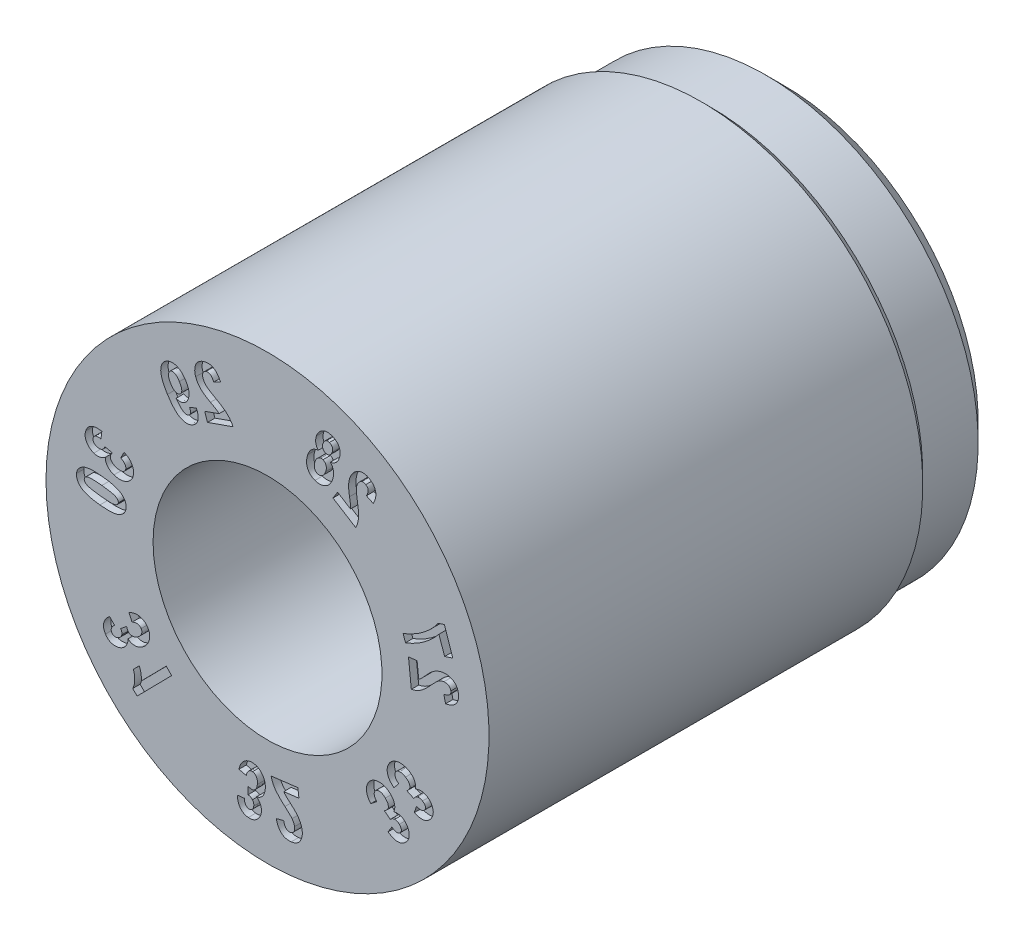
from build123d import *

# Parameters (mm, degrees)
CUT_EXTRUDE3_DEPTH = 0.2


with BuildPart() as part:
    # Sketch2 → Revolve1 (revolve)
    with BuildSketch(Plane(origin=(0, 0, 0), x_dir=(1, 0, 0), z_dir=(0, 1, 0)), mode=Mode.PRIVATE) as revolve1_sk:
        Polygon((5.249621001, 14), (1.5, 14), (1.5, 10), (3.1, 10), (3.1, 0), (6, 0), (6, 11.75), (5.75, 12), (5.75, 13.499621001), align=None)
    revolve(revolve1_sk.sketch.rotate(Axis((0, 0, -4.849143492), (0, 0, 1)), 180), axis=Axis((0, 0, -4.849143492), (0, 0, 1)))

    # Sketch9 → Cut-Extrude3 (cut)
    # profile 1 of 14: a face of its own
    with BuildSketch(Plane.XY):
        with BuildLine():
            Line((4.051983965, 0.786446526), (3.818105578, 0.761362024))
            Line((3.818105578, 0.761362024), (3.895752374, 0.037492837))
            add(Edge.make_bspline(
                [(3.895752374, 0.037492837), (3.917394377, 0.042295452), (3.960569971, 0.051876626), (4.022944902, 0.07425175), (4.083280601, 0.10160936), (4.131845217, 0.129735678), (4.170645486, 0.156529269), (4.202095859, 0.180114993), (4.235138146, 0.20782657), (4.270365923, 0.239065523), (4.307142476, 0.274522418), (4.346531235, 0.313050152), (4.387295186, 0.355951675), (4.414950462, 0.385933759), (4.429257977, 0.401445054)],
                knots=[0, 0, 0, 0, 1.210903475, 2.415741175, 3.614422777, 4.829304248, 5.477408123, 6.191639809, 6.977581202, 7.834306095, 8.765204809, 9.770030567, 10.846320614, 12, 12, 12, 12], degree=3))
            add(Edge.make_bspline(
                [(4.429257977, 0.401445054), (4.44046826, 0.413614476), (4.461863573, 0.436840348), (4.492834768, 0.469622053), (4.520832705, 0.498914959), (4.546555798, 0.52415578), (4.568802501, 0.54638062), (4.58852971, 0.564804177), (4.605450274, 0.579609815), (4.616244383, 0.587791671), (4.621051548, 0.591435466)],
                knots=[0, 0, 0, 0, 1.469359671, 2.804336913, 4.005076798, 5.067497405, 6.004650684, 6.797449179, 7.46444311, 8, 8, 8, 8], degree=3))
            add(Edge.make_bspline(
                [(4.621051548, 0.591435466), (4.633395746, 0.600004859), (4.657461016, 0.616711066), (4.696356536, 0.635570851), (4.735880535, 0.649008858), (4.762917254, 0.653190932), (4.776270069, 0.655256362)],
                knots=[0, 0, 0, 0, 1.061115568, 2.068666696, 3.046158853, 4, 4, 4, 4], degree=3))
            add(Edge.make_bspline(
                [(4.776270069, 0.655256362), (4.789826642, 0.65638101), (4.815392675, 0.658501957), (4.851748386, 0.654775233), (4.883592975, 0.646174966), (4.910512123, 0.631662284), (4.932482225, 0.612751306), (4.949045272, 0.58968634), (4.960594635, 0.563164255), (4.963575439, 0.54386861), (4.965107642, 0.53395019)],
                knots=[0, 0, 0, 0, 1.284830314, 2.42303217, 3.43989917, 4.386563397, 5.292301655, 6.158766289, 7.053562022, 8, 8, 8, 8], degree=3))
            add(Edge.make_bspline(
                [(4.965107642, 0.53395019), (4.965703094, 0.523074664), (4.966848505, 0.502154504), (4.960273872, 0.471763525), (4.946119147, 0.444959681), (4.925366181, 0.421433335), (4.897532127, 0.401633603), (4.862902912, 0.385816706), (4.821859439, 0.37234712), (4.791800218, 0.366880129), (4.775794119, 0.363969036)],
                knots=[0, 0, 0, 0, 0.913722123, 1.757635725, 2.579276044, 3.438933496, 4.37433614, 5.431505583, 6.632314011, 8, 8, 8, 8], degree=3))
            Line((4.775794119, 0.363969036), (4.823009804, 0.161799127))
            add(Edge.make_bspline(
                [(4.823009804, 0.161799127), (4.838978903, 0.165275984), (4.869992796, 0.172028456), (4.914455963, 0.184960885), (4.955238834, 0.20024305), (4.992617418, 0.216998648), (5.02629394, 0.23591328), (5.056453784, 0.256668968), (5.082986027, 0.279572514), (5.105955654, 0.304404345), (5.125459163, 0.331065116), (5.14200563, 0.359226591), (5.155306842, 0.3890594), (5.165091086, 0.420592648), (5.172371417, 0.453535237), (5.175929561, 0.48818439), (5.176243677, 0.524453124), (5.174229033, 0.549019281), (5.17319552, 0.561621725)],
                knots=[0, 0, 0, 0, 1.316678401, 2.557146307, 3.727226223, 4.823655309, 5.854584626, 6.835260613, 7.768888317, 8.673026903, 9.554907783, 10.425565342, 11.300463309, 12.180346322, 13.081818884, 14.014614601, 14.981496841, 16, 16, 16, 16], degree=3))
            add(Edge.make_bspline(
                [(5.17319552, 0.561621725), (5.171363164, 0.575283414), (5.167808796, 0.601784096), (5.158763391, 0.639971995), (5.146134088, 0.674958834), (5.130670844, 0.707279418), (5.111595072, 0.736277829), (5.089600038, 0.76266084), (5.064041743, 0.785648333), (5.035799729, 0.805620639), (5.005781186, 0.822815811), (4.974683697, 0.837092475), (4.942889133, 0.848625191), (4.910466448, 0.857569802), (4.877270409, 0.863363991), (4.843399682, 0.866828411), (4.808795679, 0.86724997), (4.785598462, 0.865232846), (4.773906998, 0.86421621)],
                knots=[0, 0, 0, 0, 1.173652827, 2.276629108, 3.335023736, 4.336619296, 5.321091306, 6.283820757, 7.254537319, 8.239831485, 9.225125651, 10.197062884, 11.150738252, 12.103199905, 13.057936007, 14.017536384, 15.000832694, 16, 16, 16, 16], degree=3))
            add(Edge.make_bspline(
                [(4.773906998, 0.86421621), (4.760578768, 0.862524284), (4.734046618, 0.859156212), (4.695072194, 0.850422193), (4.656924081, 0.839349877), (4.619548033, 0.825770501), (4.582823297, 0.80906992), (4.546432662, 0.789551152), (4.510183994, 0.766999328), (4.480100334, 0.74584356), (4.455570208, 0.7267731), (4.436127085, 0.709965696), (4.415411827, 0.691302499), (4.393619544, 0.670501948), (4.370518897, 0.648020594), (4.346585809, 0.623097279), (4.321299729, 0.596354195), (4.304260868, 0.577599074), (4.29551538, 0.567972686)],
                knots=[0, 0, 0, 0, 1.116805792, 2.223195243, 3.31725657, 4.418851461, 5.527133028, 6.669491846, 7.850789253, 9.075422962, 9.72636706, 10.433968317, 11.212223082, 12.045064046, 12.93920453, 13.892729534, 14.918407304, 16, 16, 16, 16], degree=3))
            add(Edge.make_bspline(
                [(4.29551538, 0.567972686), (4.287414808, 0.559065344), (4.271981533, 0.542095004), (4.249877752, 0.518000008), (4.229629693, 0.496716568), (4.21222484, 0.477285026), (4.196138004, 0.461177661), (4.182841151, 0.447024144), (4.171265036, 0.435826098), (4.154034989, 0.419239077), (4.13000622, 0.39835932), (4.106947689, 0.383434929), (4.095871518, 0.376265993)],
                knots=[0, 0, 0, 0, 1.30077431, 2.478245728, 3.532467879, 4.474445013, 5.295791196, 5.991390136, 6.572169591, 7.035389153, 8.575948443, 10, 10, 10, 10], degree=3))
            Line((4.095871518, 0.376265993), (4.051983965, 0.786446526))
        make_face()
    # profile 2 of 14: a face of its own
    with BuildSketch(Plane.XY):
        with BuildLine():
            Line((4.796659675, 1.257222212), (5.019511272, 1.333042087))
            Line((5.019511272, 1.333042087), (4.790711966, 2.005973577))
            Line((4.790711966, 2.005973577), (4.616624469, 1.946719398))
            add(Edge.make_bspline(
                [(4.616624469, 1.946719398), (4.610260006, 1.936742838), (4.597165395, 1.91621649), (4.575191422, 1.885529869), (4.55075415, 1.853878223), (4.523343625, 1.821542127), (4.493918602, 1.787836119), (4.461315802, 1.753630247), (4.426649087, 1.717928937), (4.376317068, 1.669490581), (4.309888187, 1.60930339), (4.22484693, 1.540910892), (4.134712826, 1.47639), (4.056169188, 1.426240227), (3.992155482, 1.388171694), (3.944613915, 1.361342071), (3.897738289, 1.336438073), (3.851558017, 1.313412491), (3.806105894, 1.292173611), (3.761258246, 1.27309259), (3.717455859, 1.255214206), (3.688075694, 1.24507226), (3.673607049, 1.240077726)],
                knots=[0, 0, 0, 0, 0.59319857, 1.220480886, 1.891472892, 2.597434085, 3.345402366, 4.134310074, 4.966143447, 5.840124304, 7.636039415, 9.45836528, 11.308165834, 13.190672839, 14.128457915, 15.041954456, 15.92725675, 16.789349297, 17.628831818, 18.442016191, 19.232750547, 20, 20, 20, 20], degree=3))
            Line((3.673607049, 1.240077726), (3.738138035, 1.050786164))
            add(Edge.make_bspline(
                [(3.738138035, 1.050786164), (3.760069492, 1.059096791), (3.803975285, 1.075734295), (3.868681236, 1.103864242), (3.932873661, 1.133681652), (3.995923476, 1.166577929), (4.05833487, 1.201290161), (4.119885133, 1.238502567), (4.180504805, 1.278092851), (4.240107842, 1.319878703), (4.298099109, 1.363605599), (4.354350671, 1.408426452), (4.408283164, 1.454661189), (4.459844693, 1.5021857), (4.50950718, 1.550774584), (4.556793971, 1.600670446), (4.601899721, 1.651834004), (4.630186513, 1.687127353), (4.644301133, 1.704738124)],
                knots=[0, 0, 0, 0, 0.995131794, 1.992209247, 2.993331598, 3.998154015, 5.009292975, 6.023543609, 7.049650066, 8.081247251, 9.111904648, 10.131308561, 11.132997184, 12.125745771, 13.106564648, 14.080818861, 15.042361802, 16, 16, 16, 16], degree=3))
            Line((4.644301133, 1.704738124), (4.796659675, 1.257222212))
        make_face()
    # profile 3 of 14: a face of its own
    with BuildSketch(Plane.XY):
        with BuildLine():
            Line((1.899037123, 3.663217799), (1.773915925, 3.464487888))
            Line((1.773915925, 3.464487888), (2.38955478, 3.077062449))
            add(Edge.make_bspline(
                [(2.38955478, 3.077062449), (2.399094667, 3.097034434), (2.418137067, 3.136900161), (2.43979156, 3.199464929), (2.45516915, 3.263836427), (2.463613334, 3.319173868), (2.466643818, 3.366177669), (2.46739274, 3.405462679), (2.466188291, 3.448561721), (2.463282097, 3.495548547), (2.458736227, 3.546362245), (2.452286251, 3.600999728), (2.444642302, 3.659529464), (2.438154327, 3.699707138), (2.434794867, 3.720511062)],
                knots=[0, 0, 0, 0, 1.210878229, 2.417012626, 3.615438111, 4.830019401, 5.475645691, 6.192571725, 6.980120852, 7.835077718, 8.769209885, 9.772331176, 10.846517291, 12, 12, 12, 12], degree=3))
            add(Edge.make_bspline(
                [(2.434794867, 3.720511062), (2.432198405, 3.736802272), (2.427232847, 3.767958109), (2.420607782, 3.812544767), (2.415368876, 3.852753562), (2.410871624, 3.8884209), (2.407887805, 3.919691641), (2.405549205, 3.946506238), (2.404435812, 3.969032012), (2.404711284, 3.982581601), (2.404834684, 3.988651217)],
                knots=[0, 0, 0, 0, 1.465856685, 2.803351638, 4.00510821, 5.068867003, 5.997475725, 6.796058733, 7.460687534, 8, 8, 8, 8], degree=3))
            add(Edge.make_bspline(
                [(2.404834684, 3.988651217), (2.405834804, 4.003609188), (2.407791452, 4.032873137), (2.416799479, 4.075069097), (2.430943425, 4.114353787), (2.444410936, 4.138075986), (2.451103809, 4.149865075)],
                knots=[0, 0, 0, 0, 1.059540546, 2.07289758, 3.042298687, 4, 4, 4, 4], degree=3))
            add(Edge.make_bspline(
                [(2.451103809, 4.149865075), (2.458658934, 4.161138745), (2.472910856, 4.182405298), (2.498202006, 4.208622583), (2.524423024, 4.228622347), (2.552497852, 4.240356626), (2.580779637, 4.245967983), (2.609028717, 4.244815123), (2.636982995, 4.237348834), (2.653953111, 4.227749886), (2.662686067, 4.222810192)],
                knots=[0, 0, 0, 0, 1.285206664, 2.424402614, 3.441215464, 4.390922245, 5.284732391, 6.156266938, 7.051200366, 8, 8, 8, 8], degree=3))
            add(Edge.make_bspline(
                [(2.662686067, 4.222810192), (2.671562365, 4.216491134), (2.688632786, 4.204338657), (2.708498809, 4.180410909), (2.721186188, 4.152844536), (2.725964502, 4.121801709), (2.72476529, 4.087795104), (2.7157004, 4.050732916), (2.700680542, 4.01038319), (2.686434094, 3.983455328), (2.678867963, 3.969154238)],
                knots=[0, 0, 0, 0, 0.914935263, 1.759554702, 2.587054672, 3.439408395, 4.381397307, 5.436256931, 6.638424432, 8, 8, 8, 8], degree=3))
            Line((2.678867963, 3.969154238), (2.866706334, 3.880993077))
            add(Edge.make_bspline(
                [(2.866706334, 3.880993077), (2.873827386, 3.895737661), (2.88762851, 3.924313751), (2.904973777, 3.967168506), (2.918497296, 4.008422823), (2.928644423, 4.047999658), (2.934583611, 4.086097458), (2.936860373, 4.122653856), (2.935338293, 4.157671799), (2.930088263, 4.191135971), (2.921427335, 4.22305573), (2.909109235, 4.253318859), (2.894162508, 4.282408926), (2.875576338, 4.309740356), (2.853805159, 4.335581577), (2.828990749, 4.360046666), (2.800732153, 4.382775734), (2.780233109, 4.396425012), (2.769776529, 4.403387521)],
                knots=[0, 0, 0, 0, 1.319619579, 2.557519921, 3.723185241, 4.816983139, 5.847055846, 6.826399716, 7.764797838, 8.666461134, 9.551571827, 10.424306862, 11.295616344, 12.183152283, 13.082111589, 14.015501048, 14.987705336, 16, 16, 16, 16], degree=3))
            add(Edge.make_bspline(
                [(2.769776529, 4.403387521), (2.75800713, 4.410510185), (2.735166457, 4.424333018), (2.699449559, 4.440317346), (2.664320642, 4.452585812), (2.629328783, 4.459973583), (2.594809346, 4.463299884), (2.560612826, 4.462271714), (2.526798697, 4.456370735), (2.49369104, 4.446604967), (2.461665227, 4.433505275), (2.431159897, 4.417978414), (2.402387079, 4.400302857), (2.375217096, 4.38053109), (2.350164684, 4.35792848), (2.326616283, 4.333279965), (2.304699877, 4.306448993), (2.291939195, 4.287030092), (2.285476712, 4.27719564)],
                knots=[0, 0, 0, 0, 1.171777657, 2.274049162, 3.329050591, 4.338472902, 5.314926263, 6.279469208, 7.245572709, 8.232913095, 9.216726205, 10.191308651, 11.147919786, 12.09292228, 13.051711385, 14.02012109, 14.997315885, 16, 16, 16, 16], degree=3))
            add(Edge.make_bspline(
                [(2.285476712, 4.27719564), (2.278561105, 4.265743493), (2.264773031, 4.24291064), (2.24731387, 4.207078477), (2.232320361, 4.170360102), (2.220064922, 4.132597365), (2.210383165, 4.093474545), (2.203233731, 4.052834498), (2.198115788, 4.010455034), (2.196213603, 3.973729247), (2.196270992, 3.942644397), (2.196826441, 3.916970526), (2.198747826, 3.889180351), (2.201582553, 3.859276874), (2.204904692, 3.827193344), (2.209576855, 3.793026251), (2.215124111, 3.756643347), (2.21926066, 3.731729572), (2.221394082, 3.718880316)],
                knots=[0, 0, 0, 0, 1.113392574, 2.219839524, 3.314461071, 4.41339063, 5.5222573, 6.667288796, 7.846932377, 9.074442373, 9.726125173, 10.434880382, 11.21206537, 12.044723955, 12.935826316, 13.89732637, 14.91554799, 16, 16, 16, 16], degree=3))
            add(Edge.make_bspline(
                [(2.221394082, 3.718880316), (2.223302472, 3.707025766), (2.226926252, 3.684515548), (2.232302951, 3.652360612), (2.236675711, 3.623482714), (2.240367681, 3.597736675), (2.243350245, 3.575259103), (2.246229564, 3.556015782), (2.247961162, 3.539949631), (2.250032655, 3.516003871), (2.251348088, 3.484188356), (2.249003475, 3.456803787), (2.247884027, 3.443728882)],
                knots=[0, 0, 0, 0, 1.299096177, 2.466811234, 3.527181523, 4.459019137, 5.280810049, 5.980418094, 6.563955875, 7.028646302, 8.581311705, 10, 10, 10, 10], degree=3))
            Line((2.247884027, 3.443728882), (1.899037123, 3.663217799))
        make_face()
    # profile 4 of 14: a face of its own
    with BuildSketch(Plane.XY):
        with BuildLine():
            add(Edge.make_bspline(
                [(1.703362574, 4.26979084), (1.717249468, 4.272237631), (1.744377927, 4.277017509), (1.7829136, 4.290442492), (1.81794996, 4.309204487), (1.850025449, 4.332601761), (1.87851194, 4.361397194), (1.903237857, 4.3952479), (1.924947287, 4.433704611), (1.935750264, 4.461896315), (1.941326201, 4.476447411)],
                knots=[0, 0, 0, 0, 1.014369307, 1.981600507, 2.923907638, 3.86750838, 4.830476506, 5.828199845, 6.879029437, 8, 8, 8, 8], degree=3))
            add(Edge.make_bspline(
                [(1.941326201, 4.476447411), (1.945321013, 4.488595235), (1.953097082, 4.512241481), (1.961520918, 4.547839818), (1.966689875, 4.582502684), (1.967981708, 4.616284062), (1.966793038, 4.649114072), (1.961613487, 4.680935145), (1.953567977, 4.711850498), (1.942008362, 4.741591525), (1.927593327, 4.769797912), (1.910288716, 4.79618261), (1.889929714, 4.820206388), (1.866947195, 4.842293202), (1.841305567, 4.862590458), (1.812503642, 4.880138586), (1.781138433, 4.8959881), (1.758890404, 4.904593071), (1.747478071, 4.909007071)],
                knots=[0, 0, 0, 0, 1.145905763, 2.230553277, 3.275126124, 4.282008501, 5.257086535, 6.214897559, 7.165828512, 8.11588331, 9.069135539, 10.000669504, 10.937791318, 11.885618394, 12.854203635, 13.862834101, 14.903720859, 16, 16, 16, 16], degree=3))
            add(Edge.make_bspline(
                [(1.747478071, 4.909007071), (1.735210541, 4.913008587), (1.711360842, 4.920788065), (1.675468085, 4.92887376), (1.640765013, 4.932899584), (1.607141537, 4.933400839), (1.574774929, 4.930041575), (1.543446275, 4.92313503), (1.513671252, 4.911749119), (1.485049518, 4.897456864), (1.458298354, 4.879962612), (1.4333285, 4.860276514), (1.410015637, 4.838707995), (1.389224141, 4.814446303), (1.3700271, 4.788464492), (1.353119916, 4.760192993), (1.338035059, 4.729910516), (1.329966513, 4.708498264), (1.32587173, 4.697631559)],
                knots=[0, 0, 0, 0, 1.163810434, 2.262601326, 3.312928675, 4.310593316, 5.290339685, 6.242747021, 7.196039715, 8.158748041, 9.124249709, 10.07403018, 11.025312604, 11.984475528, 12.952360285, 13.936666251, 14.952859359, 16, 16, 16, 16], degree=3))
            add(Edge.make_bspline(
                [(1.32587173, 4.697631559), (1.321094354, 4.68267286), (1.311824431, 4.653647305), (1.304342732, 4.609531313), (1.302391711, 4.566770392), (1.306749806, 4.525614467), (1.316189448, 4.486648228), (1.330886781, 4.450397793), (1.349771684, 4.416387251), (1.366427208, 4.396574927), (1.374807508, 4.386606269)],
                knots=[0, 0, 0, 0, 1.136897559, 2.206012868, 3.232304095, 4.229794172, 5.195265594, 6.127978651, 7.058084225, 8, 8, 8, 8], degree=3))
            add(Edge.make_bspline(
                [(1.374807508, 4.386606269), (1.358173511, 4.384212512), (1.325696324, 4.379538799), (1.279785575, 4.363867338), (1.237613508, 4.342598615), (1.199800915, 4.314215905), (1.165909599, 4.279640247), (1.136030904, 4.238762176), (1.110316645, 4.191435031), (1.096840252, 4.1569761), (1.089848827, 4.139099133)],
                knots=[0, 0, 0, 0, 1.005256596, 1.962721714, 2.892328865, 3.825456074, 4.782263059, 5.784052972, 6.850387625, 8, 8, 8, 8], degree=3))
            add(Edge.make_bspline(
                [(1.089848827, 4.139099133), (1.083563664, 4.120147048), (1.071337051, 4.083279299), (1.060901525, 4.027061), (1.056217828, 3.97241165), (1.059064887, 3.919525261), (1.067282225, 3.869254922), (1.082427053, 3.822549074), (1.103054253, 3.779346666), (1.129909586, 3.740407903), (1.16175395, 3.705783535), (1.198422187, 3.676143), (1.239401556, 3.651212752), (1.269394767, 3.639343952), (1.284607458, 3.633324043)],
                knots=[0, 0, 0, 0, 1.180886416, 2.297194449, 3.376389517, 4.420753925, 5.424752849, 6.383638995, 7.317725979, 8.249356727, 9.173352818, 10.093135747, 11.032829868, 12, 12, 12, 12], degree=3))
            add(Edge.make_bspline(
                [(1.284607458, 3.633324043), (1.29679597, 3.62933225), (1.320757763, 3.621484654), (1.357358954, 3.614092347), (1.393520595, 3.610282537), (1.429194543, 3.610355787), (1.464442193, 3.614106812), (1.499088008, 3.622029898), (1.533380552, 3.633429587), (1.566913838, 3.648427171), (1.599067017, 3.66718998), (1.629231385, 3.689433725), (1.657188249, 3.714946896), (1.682968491, 3.743608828), (1.706159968, 3.775840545), (1.72722781, 3.811236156), (1.74624113, 3.849942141), (1.75673802, 3.877360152), (1.762121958, 3.891423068)],
                knots=[0, 0, 0, 0, 1.008746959, 1.983128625, 2.932350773, 3.866363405, 4.785667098, 5.716369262, 6.657964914, 7.62593945, 8.602245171, 9.582312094, 10.570208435, 11.576332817, 12.610892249, 13.690190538, 14.81528031, 16, 16, 16, 16], degree=3))
            add(Edge.make_bspline(
                [(1.762121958, 3.891423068), (1.768099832, 3.909708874), (1.779696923, 3.945183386), (1.789105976, 3.998948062), (1.792151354, 4.050729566), (1.787737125, 4.100417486), (1.776849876, 4.147678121), (1.759196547, 4.192040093), (1.734857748, 4.233359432), (1.713938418, 4.257557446), (1.703362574, 4.26979084)],
                knots=[0, 0, 0, 0, 1.141559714, 2.214628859, 3.232000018, 4.214715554, 5.167402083, 6.102925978, 7.040927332, 8, 8, 8, 8], degree=3))
        make_face()
        with BuildLine():
            add(Edge.make_bspline(
                [(1.749471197, 4.525337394), (1.745051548, 4.513868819), (1.736708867, 4.492220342), (1.718954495, 4.463993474), (1.698852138, 4.441110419), (1.675593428, 4.424691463), (1.650881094, 4.413837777), (1.625164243, 4.409162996), (1.598816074, 4.409723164), (1.581941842, 4.414687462), (1.573287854, 4.417233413)],
                knots=[0, 0, 0, 0, 1.266609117, 2.390894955, 3.425131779, 4.391582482, 5.307208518, 6.190360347, 7.071922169, 8, 8, 8, 8], degree=3))
            add(Edge.make_bspline(
                [(1.573287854, 4.417233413), (1.564817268, 4.420700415), (1.548295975, 4.427462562), (1.527189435, 4.443856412), (1.51015329, 4.464006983), (1.497470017, 4.488043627), (1.489778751, 4.515559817), (1.488544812, 4.546050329), (1.492984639, 4.579061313), (1.500015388, 4.601147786), (1.503733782, 4.61282879)],
                knots=[0, 0, 0, 0, 0.936477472, 1.826534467, 2.713325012, 3.629782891, 4.596795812, 5.622770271, 6.742740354, 8, 8, 8, 8], degree=3))
            add(Edge.make_bspline(
                [(1.503733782, 4.61282879), (1.508109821, 4.6238857), (1.516433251, 4.644916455), (1.533569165, 4.672537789), (1.553477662, 4.694990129), (1.576497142, 4.711303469), (1.601143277, 4.721944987), (1.626532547, 4.727206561), (1.652628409, 4.726786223), (1.669288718, 4.721762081), (1.677812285, 4.719191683)],
                knots=[0, 0, 0, 0, 1.244417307, 2.36693951, 3.388604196, 4.369504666, 5.29882057, 6.183174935, 7.070495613, 8, 8, 8, 8], degree=3))
            add(Edge.make_bspline(
                [(1.677812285, 4.719191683), (1.686397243, 4.715580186), (1.703074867, 4.708564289), (1.724828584, 4.692395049), (1.741754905, 4.67168611), (1.754454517, 4.647438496), (1.762061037, 4.62005639), (1.763706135, 4.590110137), (1.759928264, 4.557962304), (1.753067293, 4.536556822), (1.749471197, 4.525337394)],
                knots=[0, 0, 0, 0, 0.960169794, 1.865280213, 2.76836551, 3.702597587, 4.675586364, 5.681241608, 6.784650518, 8, 8, 8, 8], degree=3))
        make_face(mode=Mode.SUBTRACT)
        with BuildLine():
            add(Edge.make_bspline(
                [(1.576451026, 3.983605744), (1.573453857, 3.975500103), (1.567609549, 3.959694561), (1.557360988, 3.937330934), (1.546241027, 3.91694591), (1.534797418, 3.898142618), (1.521876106, 3.881719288), (1.50862083, 3.866682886), (1.494030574, 3.854066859), (1.474445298, 3.83978972), (1.44910323, 3.826597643), (1.417877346, 3.817820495), (1.386518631, 3.816805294), (1.366850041, 3.82233612), (1.356923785, 3.825127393)],
                knots=[0, 0, 0, 0, 1.031139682, 2.010663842, 2.93231511, 3.801989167, 4.633416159, 5.423097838, 6.190390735, 6.929646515, 8.313467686, 9.573244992, 10.775276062, 12, 12, 12, 12], degree=3))
            add(Edge.make_bspline(
                [(1.356923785, 3.825127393), (1.347426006, 3.829159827), (1.328757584, 3.837085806), (1.305443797, 3.857220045), (1.287130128, 3.882595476), (1.276174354, 3.907642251), (1.27007685, 3.930021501), (1.267417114, 3.948547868), (1.266997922, 3.968216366), (1.267433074, 3.989039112), (1.270628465, 4.010994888), (1.275194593, 4.034155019), (1.281944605, 4.05842424), (1.287412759, 4.074836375), (1.29022732, 4.083284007)],
                knots=[0, 0, 0, 0, 1.238575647, 2.434490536, 3.659926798, 4.989591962, 5.707140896, 6.454241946, 7.240616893, 8.078709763, 8.963675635, 9.912918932, 10.925740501, 12, 12, 12, 12], degree=3))
            add(Edge.make_bspline(
                [(1.29022732, 4.083284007), (1.295675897, 4.09734853), (1.306080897, 4.124207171), (1.327532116, 4.159728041), (1.352538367, 4.188774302), (1.380782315, 4.210763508), (1.410676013, 4.226153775), (1.441407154, 4.234265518), (1.472553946, 4.234470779), (1.492237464, 4.228939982), (1.502231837, 4.226131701)],
                knots=[0, 0, 0, 0, 1.267741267, 2.420971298, 3.473833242, 4.476546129, 5.415160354, 6.285484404, 7.129448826, 8, 8, 8, 8], degree=3))
            add(Edge.make_bspline(
                [(1.502231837, 4.226131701), (1.511733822, 4.22210221), (1.530410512, 4.214182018), (1.55379587, 4.193890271), (1.572527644, 4.168342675), (1.585908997, 4.137421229), (1.593921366, 4.102544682), (1.59508802, 4.064616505), (1.589574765, 4.024276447), (1.580954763, 3.997562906), (1.576451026, 3.983605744)],
                knots=[0, 0, 0, 0, 0.872630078, 1.715203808, 2.593262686, 3.547039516, 4.558156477, 5.617676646, 6.755295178, 8, 8, 8, 8], degree=3))
        make_face(mode=Mode.SUBTRACT)
    # profile 5 of 14: a face of its own
    with BuildSketch(Plane.XY):
        with BuildLine():
            Line((-1.703159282, 3.761572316), (-1.624473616, 3.538597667))
            Line((-1.624473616, 3.538597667), (-0.934379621, 3.782128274))
            add(Edge.make_bspline(
                [(-0.934379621, 3.782128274), (-0.944152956, 3.802142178), (-0.963633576, 3.842034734), (-0.999707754, 3.898081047), (-1.040430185, 3.950816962), (-1.07921981, 3.991847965), (-1.114135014, 4.023864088), (-1.144878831, 4.048687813), (-1.179443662, 4.074902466), (-1.218398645, 4.101890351), (-1.261207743, 4.130305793), (-1.30838821, 4.159322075), (-1.359428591, 4.18980852), (-1.395199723, 4.209867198), (-1.413697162, 4.220239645)],
                knots=[0, 0, 0, 0, 1.210201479, 2.412224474, 3.61649059, 4.828881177, 5.477045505, 6.191165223, 6.976553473, 7.835491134, 8.767497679, 9.770119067, 10.846916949, 12, 12, 12, 12], degree=3))
            add(Edge.make_bspline(
                [(-1.413697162, 4.220239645), (-1.428221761, 4.228338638), (-1.455954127, 4.243802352), (-1.495167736, 4.266451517), (-1.530359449, 4.287042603), (-1.560998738, 4.306176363), (-1.587941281, 4.322804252), (-1.610355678, 4.337920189), (-1.628827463, 4.350941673), (-1.639225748, 4.35958694), (-1.643859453, 4.363439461)],
                knots=[0, 0, 0, 0, 1.470712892, 2.808087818, 4.004923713, 5.076297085, 6.002729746, 6.804470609, 7.467245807, 8, 8, 8, 8], degree=3))
            add(Edge.make_bspline(
                [(-1.643859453, 4.363439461), (-1.655201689, 4.373508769), (-1.677313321, 4.393138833), (-1.704548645, 4.427062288), (-1.727366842, 4.462385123), (-1.737462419, 4.488012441), (-1.74246827, 4.500719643)],
                knots=[0, 0, 0, 0, 1.062536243, 2.071409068, 3.043715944, 4, 4, 4, 4], degree=3))
            add(Edge.make_bspline(
                [(-1.74246827, 4.500719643), (-1.74671345, 4.513714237), (-1.754697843, 4.538154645), (-1.759637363, 4.574568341), (-1.758476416, 4.607692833), (-1.75054742, 4.637354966), (-1.737007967, 4.663072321), (-1.718576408, 4.684631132), (-1.695357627, 4.702184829), (-1.677207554, 4.709547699), (-1.667782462, 4.713371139)],
                knots=[0, 0, 0, 0, 1.286210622, 2.419122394, 3.444309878, 4.390283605, 5.287503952, 6.160604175, 7.044826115, 8, 8, 8, 8], degree=3))
            add(Edge.make_bspline(
                [(-1.667782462, 4.713371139), (-1.657256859, 4.716507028), (-1.637008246, 4.722539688), (-1.605683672, 4.72301106), (-1.57613597, 4.715401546), (-1.548330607, 4.700462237), (-1.52266542, 4.677612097), (-1.49889772, 4.64758652), (-1.47661872, 4.610311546), (-1.464286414, 4.582264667), (-1.45772695, 4.567346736)],
                knots=[0, 0, 0, 0, 0.915761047, 1.76169387, 2.58349666, 3.443822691, 4.377330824, 5.438203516, 6.637399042, 8, 8, 8, 8], degree=3))
            Line((-1.45772695, 4.567346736), (-1.27072177, 4.66069441))
            add(Edge.make_bspline(
                [(-1.27072177, 4.66069441), (-1.277875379, 4.675527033), (-1.291751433, 4.704298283), (-1.314813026, 4.744684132), (-1.338661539, 4.781299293), (-1.363787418, 4.813885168), (-1.390355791, 4.84227045), (-1.417447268, 4.867291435), (-1.445978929, 4.888064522), (-1.475725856, 4.904538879), (-1.506314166, 4.917607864), (-1.53777315, 4.927048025), (-1.570106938, 4.932930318), (-1.603216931, 4.935443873), (-1.637256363, 4.934627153), (-1.672033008, 4.930242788), (-1.707639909, 4.922258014), (-1.731196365, 4.914603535), (-1.743279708, 4.910677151)],
                knots=[0, 0, 0, 0, 1.318787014, 2.558087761, 3.722369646, 4.816855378, 5.849242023, 6.833458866, 7.766859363, 8.668651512, 9.551729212, 10.426572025, 11.293868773, 12.17926047, 13.081931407, 14.016700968, 14.982661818, 16, 16, 16, 16], degree=3))
            add(Edge.make_bspline(
                [(-1.743279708, 4.910677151), (-1.756183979, 4.905729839), (-1.781277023, 4.896109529), (-1.816246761, 4.878114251), (-1.84785872, 4.858010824), (-1.875734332, 4.835243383), (-1.899761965, 4.809786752), (-1.920423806, 4.782238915), (-1.936974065, 4.751921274), (-1.949961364, 4.719753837), (-1.959541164, 4.686401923), (-1.966798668, 4.652785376), (-1.970239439, 4.618936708), (-1.97189292, 4.585169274), (-1.96958607, 4.551354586), (-1.965171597, 4.517416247), (-1.957244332, 4.483443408), (-1.949971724, 4.461152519), (-1.94630419, 4.449911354)],
                knots=[0, 0, 0, 0, 1.170462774, 2.276027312, 3.326355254, 4.340295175, 5.317312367, 6.286297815, 7.250188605, 8.235724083, 9.22009703, 10.187959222, 11.145682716, 12.100202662, 13.049278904, 14.013436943, 14.998187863, 16, 16, 16, 16], degree=3))
            add(Edge.make_bspline(
                [(-1.94630419, 4.449911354), (-1.941602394, 4.437253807), (-1.932261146, 4.412106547), (-1.914941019, 4.375861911), (-1.895130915, 4.341205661), (-1.8729662, 4.307804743), (-1.848363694, 4.275555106), (-1.820599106, 4.244512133), (-1.79029548, 4.214115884), (-1.762431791, 4.18973396), (-1.738053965, 4.170244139), (-1.717338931, 4.154964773), (-1.694383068, 4.138908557), (-1.668990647, 4.122571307), (-1.64154327, 4.105154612), (-1.611721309, 4.087593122), (-1.579825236, 4.068945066), (-1.557611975, 4.056757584), (-1.546127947, 4.05045678)],
                knots=[0, 0, 0, 0, 1.116929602, 2.219049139, 3.319557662, 4.417955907, 5.534029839, 6.673053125, 7.861887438, 9.083873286, 9.73461791, 10.444272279, 11.213576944, 12.052405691, 12.942635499, 13.903412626, 14.916085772, 16, 16, 16, 16], degree=3))
            add(Edge.make_bspline(
                [(-1.546127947, 4.05045678), (-1.535547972, 4.044680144), (-1.515363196, 4.033659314), (-1.486827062, 4.017293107), (-1.460984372, 4.002968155), (-1.438297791, 3.989796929), (-1.418551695, 3.978225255), (-1.40180835, 3.968085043), (-1.38793458, 3.959590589), (-1.367714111, 3.946493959), (-1.341953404, 3.927536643), (-1.321831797, 3.908656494), (-1.312202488, 3.899621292)],
                knots=[0, 0, 0, 0, 1.295135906, 2.470896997, 3.534416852, 4.469754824, 5.289409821, 5.993458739, 6.572962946, 7.037125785, 8.582099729, 10, 10, 10, 10], degree=3))
            Line((-1.312202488, 3.899621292), (-1.703159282, 3.761572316))
        make_face()
    # profile 6 of 14: a face of its own
    with BuildSketch(Plane.XY):
        with BuildLine():
            Line((-1.927710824, 3.727742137), (-2.111852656, 3.643784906))
            add(Edge.make_bspline(
                [(-2.111852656, 3.643784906), (-2.106889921, 3.633295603), (-2.097573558, 3.613604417), (-2.088261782, 3.584092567), (-2.083297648, 3.556989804), (-2.083361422, 3.53203584), (-2.088269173, 3.509317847), (-2.098402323, 3.489116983), (-2.11333297, 3.471274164), (-2.126249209, 3.462311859), (-2.132933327, 3.457673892)],
                knots=[0, 0, 0, 0, 1.333545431, 2.503416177, 3.549356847, 4.49128043, 5.355825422, 6.198119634, 7.067531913, 8, 8, 8, 8], degree=3))
            add(Edge.make_bspline(
                [(-2.132933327, 3.457673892), (-2.137809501, 3.454845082), (-2.147446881, 3.449254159), (-2.163247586, 3.44373781), (-2.179446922, 3.440150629), (-2.196285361, 3.439258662), (-2.213585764, 3.440750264), (-2.23139935, 3.444656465), (-2.249737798, 3.450873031), (-2.2688844, 3.459505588), (-2.289305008, 3.47145224), (-2.310807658, 3.488119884), (-2.33389475, 3.509288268), (-2.358771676, 3.534800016), (-2.385446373, 3.564694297), (-2.413655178, 3.599158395), (-2.44327874, 3.638360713), (-2.463324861, 3.666153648), (-2.473817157, 3.680700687)],
                knots=[0, 0, 0, 0, 0.605293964, 1.196316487, 1.792005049, 2.385442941, 3.002739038, 3.655141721, 4.342670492, 5.082630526, 5.911533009, 6.881802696, 8.003477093, 9.27974969, 10.714100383, 12.312991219, 14.070190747, 16, 16, 16, 16], degree=3))
            add(Edge.make_bspline(
                [(-2.473817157, 3.680700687), (-2.463774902, 3.67679054), (-2.444130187, 3.669141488), (-2.414167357, 3.661648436), (-2.384888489, 3.657335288), (-2.356296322, 3.656555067), (-2.328472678, 3.659639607), (-2.30131228, 3.666221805), (-2.274879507, 3.676599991), (-2.258303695, 3.686212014), (-2.249935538, 3.691064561)],
                knots=[0, 0, 0, 0, 1.106417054, 2.164379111, 3.165396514, 4.142586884, 5.094647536, 6.033218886, 7.007087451, 8, 8, 8, 8], degree=3))
            add(Edge.make_bspline(
                [(-2.249935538, 3.691064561), (-2.241554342, 3.696807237), (-2.224929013, 3.708198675), (-2.202887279, 3.728832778), (-2.183255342, 3.75175883), (-2.166758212, 3.777708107), (-2.152678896, 3.806134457), (-2.141709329, 3.837401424), (-2.13326209, 3.871129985), (-2.127407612, 3.907100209), (-2.124917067, 3.944725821), (-2.126382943, 3.983225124), (-2.131523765, 4.022134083), (-2.140478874, 4.061442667), (-2.153157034, 4.101250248), (-2.170051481, 4.141397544), (-2.190144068, 4.182216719), (-2.206159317, 4.208738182), (-2.214342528, 4.222289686)],
                knots=[0, 0, 0, 0, 0.825484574, 1.637469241, 2.447860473, 3.274909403, 4.132031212, 5.023192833, 5.964787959, 6.957576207, 7.984017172, 9.026978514, 10.086650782, 11.172243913, 12.302596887, 13.480647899, 14.712702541, 16, 16, 16, 16], degree=3))
            add(Edge.make_bspline(
                [(-2.214342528, 4.222289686), (-2.223602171, 4.236515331), (-2.24162195, 4.264199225), (-2.271367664, 4.30228971), (-2.301948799, 4.336605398), (-2.333717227, 4.366953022), (-2.366888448, 4.393157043), (-2.401166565, 4.415387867), (-2.436528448, 4.433821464), (-2.472974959, 4.447695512), (-2.50948587, 4.457721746), (-2.545597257, 4.463656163), (-2.580909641, 4.466308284), (-2.615590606, 4.464402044), (-2.649532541, 4.458661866), (-2.682651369, 4.448831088), (-2.715095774, 4.435235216), (-2.735458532, 4.423201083), (-2.745789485, 4.41709562)],
                knots=[0, 0, 0, 0, 1.285306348, 2.501277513, 3.656832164, 4.764832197, 5.824913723, 6.854277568, 7.855662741, 8.839744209, 9.802845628, 10.718914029, 11.608147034, 12.479923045, 13.343235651, 14.209959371, 15.091830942, 16, 16, 16, 16], degree=3))
            add(Edge.make_bspline(
                [(-2.745789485, 4.41709562), (-2.756900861, 4.409663), (-2.778765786, 4.395037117), (-2.807133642, 4.367959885), (-2.831733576, 4.338205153), (-2.852532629, 4.305340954), (-2.868529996, 4.269085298), (-2.880815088, 4.229902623), (-2.888817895, 4.187624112), (-2.892801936, 4.142065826), (-2.891651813, 4.093108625), (-2.883936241, 4.040641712), (-2.870192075, 3.984737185), (-2.850537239, 3.925196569), (-2.824200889, 3.862307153), (-2.791991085, 3.795766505), (-2.753817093, 3.725451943), (-2.724840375, 3.678325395), (-2.709804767, 3.653872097)],
                knots=[0, 0, 0, 0, 0.751071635, 1.477956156, 2.196948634, 2.919932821, 3.658804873, 4.420540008, 5.226119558, 6.07530139, 6.989881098, 7.975115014, 9.05335499, 10.225987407, 11.499888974, 12.88722807, 14.384826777, 16, 16, 16, 16], degree=3))
            add(Edge.make_bspline(
                [(-2.709804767, 3.653872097), (-2.693935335, 3.62931885), (-2.663338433, 3.581979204), (-2.615683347, 3.515800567), (-2.568884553, 3.456634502), (-2.522078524, 3.404946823), (-2.475783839, 3.360451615), (-2.430051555, 3.322819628), (-2.384654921, 3.292540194), (-2.339413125, 3.269809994), (-2.294966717, 3.253536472), (-2.251511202, 3.242324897), (-2.208905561, 3.236220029), (-2.167138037, 3.235874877), (-2.126226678, 3.240743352), (-2.086306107, 3.251182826), (-2.047163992, 3.266660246), (-2.022760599, 3.280956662), (-2.010368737, 3.288216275)],
                knots=[0, 0, 0, 0, 1.587513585, 3.060789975, 4.427135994, 5.682347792, 6.844687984, 7.911430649, 8.894829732, 9.801705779, 10.654271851, 11.460690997, 12.23508701, 12.985598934, 13.722707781, 14.465884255, 15.220987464, 16, 16, 16, 16], degree=3))
            add(Edge.make_bspline(
                [(-2.010368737, 3.288216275), (-2.002078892, 3.293739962), (-1.985772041, 3.304605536), (-1.963530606, 3.323058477), (-1.943687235, 3.342826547), (-1.926493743, 3.3642683), (-1.911648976, 3.387091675), (-1.899022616, 3.411194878), (-1.889128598, 3.436830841), (-1.881798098, 3.463866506), (-1.876852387, 3.492323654), (-1.875663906, 3.522121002), (-1.876659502, 3.553229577), (-1.881262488, 3.585612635), (-1.888052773, 3.619467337), (-1.898549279, 3.654447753), (-1.91158565, 3.690892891), (-1.922230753, 3.715219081), (-1.927710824, 3.727742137)],
                knots=[0, 0, 0, 0, 0.964010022, 1.896292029, 2.79306447, 3.671735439, 4.552105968, 5.425658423, 6.301560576, 7.207041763, 8.134501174, 9.091468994, 10.089233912, 11.144269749, 12.254364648, 13.429669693, 14.67680093, 16, 16, 16, 16], degree=3))
        make_face()
        with BuildLine():
            add(Edge.make_bspline(
                [(-2.619176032, 3.945316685), (-2.624434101, 3.953889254), (-2.634632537, 3.970516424), (-2.647795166, 3.995751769), (-2.658995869, 4.020091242), (-2.668038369, 4.043771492), (-2.674303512, 4.066842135), (-2.679129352, 4.089058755), (-2.681078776, 4.110610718), (-2.681364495, 4.131296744), (-2.679587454, 4.150724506), (-2.676350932, 4.168768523), (-2.671806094, 4.185292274), (-2.665463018, 4.200214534), (-2.657878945, 4.213655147), (-2.648763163, 4.225517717), (-2.638517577, 4.236193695), (-2.630357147, 4.241645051), (-2.626293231, 4.244359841)],
                knots=[0, 0, 0, 0, 1.463770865, 2.839098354, 4.140632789, 5.36344726, 6.523940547, 7.618493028, 8.668527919, 9.66844562, 10.626947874, 11.503689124, 12.335022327, 13.115942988, 13.858714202, 14.575081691, 15.290386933, 16, 16, 16, 16], degree=3))
            add(Edge.make_bspline(
                [(-2.626293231, 4.244359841), (-2.618150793, 4.248775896), (-2.601964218, 4.257554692), (-2.574015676, 4.261806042), (-2.54481634, 4.259214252), (-2.520050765, 4.25117445), (-2.499737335, 4.241178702), (-2.484287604, 4.230370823), (-2.468251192, 4.217693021), (-2.452231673, 4.202075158), (-2.436218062, 4.183737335), (-2.419475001, 4.16323582), (-2.402843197, 4.140006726), (-2.392167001, 4.123375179), (-2.386649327, 4.114779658)],
                knots=[0, 0, 0, 0, 1.09100677, 2.168841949, 3.291229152, 4.542598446, 5.230660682, 5.968608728, 6.772250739, 7.652532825, 8.615705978, 9.657334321, 10.78926293, 12, 12, 12, 12], degree=3))
            add(Edge.make_bspline(
                [(-2.386649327, 4.114779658), (-2.381286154, 4.106039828), (-2.370905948, 4.089124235), (-2.357261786, 4.063751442), (-2.345658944, 4.039554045), (-2.336538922, 4.016323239), (-2.329547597, 3.994217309), (-2.32475256, 3.973257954), (-2.322159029, 3.953342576), (-2.322031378, 3.92903101), (-2.326057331, 3.901137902), (-2.336891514, 3.871382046), (-2.354442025, 3.846598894), (-2.370222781, 3.834927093), (-2.378163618, 3.829053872)],
                knots=[0, 0, 0, 0, 1.159949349, 2.245035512, 3.2578894, 4.194310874, 5.066231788, 5.87872087, 6.624067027, 7.333354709, 8.624174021, 9.790265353, 10.888067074, 12, 12, 12, 12], degree=3))
            add(Edge.make_bspline(
                [(-2.378163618, 3.829053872), (-2.386547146, 3.824563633), (-2.40332429, 3.815577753), (-2.432272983, 3.810951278), (-2.462781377, 3.813289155), (-2.488743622, 3.821189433), (-2.509894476, 3.831003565), (-2.526248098, 3.840709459), (-2.542380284, 3.852690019), (-2.558244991, 3.866998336), (-2.573730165, 3.88353949), (-2.589292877, 3.902042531), (-2.60449773, 3.92284346), (-2.61418498, 3.937675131), (-2.619176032, 3.945316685)],
                knots=[0, 0, 0, 0, 1.143789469, 2.288955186, 3.486415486, 4.821791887, 5.545574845, 6.304454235, 7.117946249, 7.972564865, 8.885341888, 9.857059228, 10.895916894, 12, 12, 12, 12], degree=3))
        make_face(mode=Mode.SUBTRACT)
    # profile 7 of 14: a face of its own
    with BuildSketch(Plane.XY):
        with BuildLine():
            Line((-3.884187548, 1.709273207), (-3.977323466, 1.528364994))
            add(Edge.make_bspline(
                [(-3.977323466, 1.528364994), (-3.963926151, 1.522001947), (-3.938395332, 1.509876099), (-3.904877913, 1.487123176), (-3.877712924, 1.462093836), (-3.857508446, 1.43468453), (-3.844205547, 1.405985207), (-3.836998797, 1.377193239), (-3.836270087, 1.348184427), (-3.841408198, 1.329914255), (-3.84400509, 1.320680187)],
                knots=[0, 0, 0, 0, 1.307267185, 2.49121576, 3.559776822, 4.552195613, 5.475464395, 6.33309862, 7.157518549, 8, 8, 8, 8], degree=3))
            add(Edge.make_bspline(
                [(-3.84400509, 1.320680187), (-3.847988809, 1.311100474), (-3.855873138, 1.2921409), (-3.876630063, 1.268462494), (-3.902839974, 1.249287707), (-3.929270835, 1.238408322), (-3.952518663, 1.232217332), (-3.971358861, 1.228993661), (-3.991058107, 1.227765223), (-4.011701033, 1.227847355), (-4.033153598, 1.230498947), (-4.055562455, 1.234496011), (-4.078801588, 1.240326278), (-4.094408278, 1.245331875), (-4.102399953, 1.247895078)],
                knots=[0, 0, 0, 0, 1.242637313, 2.459350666, 3.7359762, 5.127648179, 5.872050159, 6.633282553, 7.425647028, 8.247473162, 9.116384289, 10.025704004, 10.989027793, 12, 12, 12, 12], degree=3))
            add(Edge.make_bspline(
                [(-4.102399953, 1.247895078), (-4.116742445, 1.253261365), (-4.143932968, 1.263434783), (-4.180225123, 1.284135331), (-4.210072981, 1.30814173), (-4.232800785, 1.335523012), (-4.248568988, 1.364463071), (-4.257210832, 1.393905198), (-4.258851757, 1.423672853), (-4.253843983, 1.442513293), (-4.251307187, 1.452057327)],
                knots=[0, 0, 0, 0, 1.30575028, 2.475443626, 3.550711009, 4.55861283, 5.493597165, 6.344366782, 7.16130304, 8, 8, 8, 8], degree=3))
            add(Edge.make_bspline(
                [(-4.251307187, 1.452057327), (-4.24881908, 1.458556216), (-4.243605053, 1.472175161), (-4.232753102, 1.492617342), (-4.218784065, 1.513880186), (-4.208160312, 1.528167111), (-4.202616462, 1.535622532)],
                knots=[0, 0, 0, 0, 0.859195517, 1.800513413, 2.852230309, 4, 4, 4, 4], degree=3))
            Line((-4.202616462, 1.535622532), (-4.405655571, 1.580862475))
            add(Edge.make_bspline(
                [(-4.405655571, 1.580862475), (-4.409945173, 1.568852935), (-4.418139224, 1.545912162), (-4.436969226, 1.51584113), (-4.459784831, 1.491239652), (-4.478365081, 1.480046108), (-4.487521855, 1.474529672)],
                knots=[0, 0, 0, 0, 1.108494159, 2.117459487, 3.072240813, 4, 4, 4, 4], degree=3))
            add(Edge.make_bspline(
                [(-4.487521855, 1.474529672), (-4.497468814, 1.470319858), (-4.517462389, 1.461858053), (-4.551085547, 1.458139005), (-4.586772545, 1.461151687), (-4.610536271, 1.468212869), (-4.622949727, 1.471901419)],
                knots=[0, 0, 0, 0, 0.927981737, 1.865260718, 2.884876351, 4, 4, 4, 4], degree=3))
            add(Edge.make_bspline(
                [(-4.622949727, 1.471901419), (-4.633095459, 1.47572963), (-4.652422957, 1.483022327), (-4.67812735, 1.498218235), (-4.698834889, 1.516496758), (-4.714534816, 1.537311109), (-4.724618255, 1.560003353), (-4.730353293, 1.583539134), (-4.729620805, 1.608052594), (-4.725273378, 1.623832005), (-4.723050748, 1.631899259)],
                knots=[0, 0, 0, 0, 1.225845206, 2.335220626, 3.358388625, 4.334297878, 5.261091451, 6.151349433, 7.05487391, 8, 8, 8, 8], degree=3))
            add(Edge.make_bspline(
                [(-4.723050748, 1.631899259), (-4.719856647, 1.639844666), (-4.71354617, 1.655542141), (-4.696895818, 1.675224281), (-4.676468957, 1.69201086), (-4.651063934, 1.704659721), (-4.621454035, 1.712853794), (-4.587874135, 1.715117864), (-4.55060881, 1.712614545), (-4.525022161, 1.706752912), (-4.511497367, 1.703654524)],
                knots=[0, 0, 0, 0, 0.828722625, 1.63727956, 2.47642108, 3.390131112, 4.377560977, 5.448143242, 6.651119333, 8, 8, 8, 8], degree=3))
            Line((-4.511497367, 1.703654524), (-4.4871654, 1.898480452))
            add(Edge.make_bspline(
                [(-4.4871654, 1.898480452), (-4.50191853, 1.900719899), (-4.530460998, 1.905052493), (-4.57237961, 1.908352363), (-4.611834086, 1.909700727), (-4.64902332, 1.907829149), (-4.683820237, 1.90324079), (-4.716271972, 1.896094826), (-4.746426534, 1.886406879), (-4.774157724, 1.873802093), (-4.799708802, 1.858797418), (-4.823262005, 1.841621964), (-4.844702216, 1.822092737), (-4.864452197, 1.800641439), (-4.882091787, 1.776845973), (-4.897691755, 1.750932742), (-4.911205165, 1.722781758), (-4.918597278, 1.703003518), (-4.922377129, 1.692890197)],
                knots=[0, 0, 0, 0, 1.345194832, 2.602510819, 3.789383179, 4.902843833, 5.956107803, 6.950910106, 7.895541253, 8.806779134, 9.691889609, 10.563382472, 11.43043814, 12.303008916, 13.188814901, 14.09663162, 15.026739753, 16, 16, 16, 16], degree=3))
            add(Edge.make_bspline(
                [(-4.922377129, 1.692890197), (-4.92598438, 1.681449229), (-4.933064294, 1.658994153), (-4.939348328, 1.624924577), (-4.941843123, 1.591502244), (-4.940870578, 1.558834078), (-4.935690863, 1.526877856), (-4.927159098, 1.49573407), (-4.914801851, 1.465304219), (-4.898521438, 1.436245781), (-4.879976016, 1.408482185), (-4.859787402, 1.382650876), (-4.837946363, 1.359182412), (-4.814381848, 1.338346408), (-4.789399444, 1.319672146), (-4.762880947, 1.303259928), (-4.73482316, 1.289155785), (-4.715044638, 1.282030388), (-4.705124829, 1.278456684)],
                knots=[0, 0, 0, 0, 1.103629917, 2.166083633, 3.180617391, 4.184673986, 5.167406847, 6.153811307, 7.151995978, 8.182783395, 9.214750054, 10.223539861, 11.197883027, 12.16187297, 13.115538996, 14.065975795, 15.030000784, 16, 16, 16, 16], degree=3))
            add(Edge.make_bspline(
                [(-4.705124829, 1.278456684), (-4.691616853, 1.274396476), (-4.665084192, 1.266421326), (-4.624381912, 1.260188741), (-4.584108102, 1.259918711), (-4.544234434, 1.264463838), (-4.504974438, 1.274908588), (-4.466137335, 1.290252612), (-4.427811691, 1.311163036), (-4.403710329, 1.32856945), (-4.391317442, 1.337519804)],
                knots=[0, 0, 0, 0, 1.013798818, 1.99132584, 2.949589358, 3.903343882, 4.86941014, 5.862946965, 6.901130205, 8, 8, 8, 8], degree=3))
            add(Edge.make_bspline(
                [(-4.391317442, 1.337519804), (-4.391589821, 1.329736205), (-4.392127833, 1.314361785), (-4.390783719, 1.291395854), (-4.387041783, 1.268798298), (-4.381382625, 1.2465743), (-4.373592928, 1.224724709), (-4.363432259, 1.203512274), (-4.351733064, 1.182389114), (-4.337465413, 1.162151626), (-4.321867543, 1.142363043), (-4.303755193, 1.124219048), (-4.284270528, 1.106988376), (-4.262775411, 1.091147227), (-4.23953679, 1.076547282), (-4.214435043, 1.063448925), (-4.187782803, 1.051102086), (-4.168992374, 1.044461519), (-4.159375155, 1.041062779)],
                knots=[0, 0, 0, 0, 0.920509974, 1.818221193, 2.71444161, 3.624542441, 4.52646422, 5.451803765, 6.402682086, 7.377516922, 8.376068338, 9.377795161, 10.403703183, 11.448979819, 12.53087404, 13.645040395, 14.79469689, 16, 16, 16, 16], degree=3))
            add(Edge.make_bspline(
                [(-4.159375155, 1.041062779), (-4.145217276, 1.036585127), (-4.117534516, 1.027830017), (-4.07557494, 1.019173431), (-4.034597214, 1.013620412), (-3.994193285, 1.012545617), (-3.954497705, 1.015049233), (-3.915520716, 1.021533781), (-3.877462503, 1.032121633), (-3.84053693, 1.045890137), (-3.805555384, 1.062839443), (-3.77332929, 1.082518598), (-3.744024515, 1.104374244), (-3.717854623, 1.128884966), (-3.694984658, 1.155953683), (-3.674992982, 1.185327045), (-3.658056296, 1.217064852), (-3.649709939, 1.239742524), (-3.645499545, 1.25118248)],
                knots=[0, 0, 0, 0, 1.152525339, 2.253521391, 3.322678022, 4.360153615, 5.386914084, 6.407544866, 7.422719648, 8.450299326, 9.464360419, 10.436664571, 11.378727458, 12.298711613, 13.214977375, 14.125056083, 15.054167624, 16, 16, 16, 16], degree=3))
            add(Edge.make_bspline(
                [(-3.645499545, 1.25118248), (-3.642014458, 1.262363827), (-3.635164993, 1.284339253), (-3.628686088, 1.317856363), (-3.625924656, 1.351064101), (-3.626131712, 1.384028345), (-3.630289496, 1.416716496), (-3.637436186, 1.449130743), (-3.648097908, 1.481243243), (-3.662315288, 1.512688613), (-3.679449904, 1.543223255), (-3.699836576, 1.572192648), (-3.722872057, 1.599652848), (-3.749458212, 1.624998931), (-3.778526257, 1.649074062), (-3.811161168, 1.670806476), (-3.846267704, 1.691485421), (-3.871387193, 1.7032687), (-3.884187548, 1.709273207)],
                knots=[0, 0, 0, 0, 0.983274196, 1.932492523, 2.86034437, 3.778659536, 4.696147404, 5.622816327, 6.563043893, 7.532752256, 8.517569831, 9.499641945, 10.504335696, 11.523068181, 12.580995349, 13.670589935, 14.812982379, 16, 16, 16, 16], degree=3))
        make_face()
    # profile 8 of 14: a face of its own
    with BuildSketch(Plane.XY):
        with BuildLine():
            add(Edge.make_bspline(
                [(-5.172581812, 0.569088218), (-5.173581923, 0.556251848), (-5.17554855, 0.53101031), (-5.172339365, 0.493465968), (-5.164213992, 0.457343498), (-5.151555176, 0.42254453), (-5.133902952, 0.389125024), (-5.110877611, 0.357520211), (-5.083531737, 0.326960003), (-5.050998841, 0.29782049), (-5.01231136, 0.270336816), (-4.966200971, 0.245724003), (-4.912996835, 0.223110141), (-4.85254034, 0.202870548), (-4.784923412, 0.184689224), (-4.7098677, 0.169348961), (-4.627734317, 0.15534321), (-4.570271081, 0.14863948), (-4.540429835, 0.145158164)],
                knots=[0, 0, 0, 0, 0.726651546, 1.428893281, 2.119620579, 2.81387727, 3.515502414, 4.247964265, 5.018108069, 5.829211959, 6.711056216, 7.693155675, 8.776761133, 9.974752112, 11.293072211, 12.731177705, 14.30246717, 16, 16, 16, 16], degree=3))
            add(Edge.make_bspline(
                [(-4.540429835, 0.145158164), (-4.510607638, 0.142185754), (-4.453148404, 0.13645873), (-4.370053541, 0.131686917), (-4.293490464, 0.13081606), (-4.223626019, 0.1338614), (-4.16032643, 0.140703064), (-4.103526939, 0.150841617), (-4.053312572, 0.165239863), (-4.009463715, 0.183437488), (-3.971488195, 0.205218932), (-3.937837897, 0.22862204), (-3.908637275, 0.254610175), (-3.884119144, 0.283151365), (-3.863821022, 0.31404336), (-3.848662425, 0.347599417), (-3.837074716, 0.383221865), (-3.833586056, 0.408174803), (-3.831812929, 0.420857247)],
                knots=[0, 0, 0, 0, 1.696309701, 3.268325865, 4.709570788, 6.028728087, 7.224206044, 8.311223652, 9.290562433, 10.175370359, 10.991302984, 11.764050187, 12.491981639, 13.197460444, 13.88836042, 14.576333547, 15.276415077, 16, 16, 16, 16], degree=3))
            add(Edge.make_bspline(
                [(-3.831812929, 0.420857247), (-3.83080371, 0.433695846), (-3.828819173, 0.458941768), (-3.832155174, 0.496416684), (-3.839766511, 0.532548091), (-3.852800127, 0.567176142), (-3.870143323, 0.600562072), (-3.892713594, 0.632337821), (-3.919908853, 0.662829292), (-3.946345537, 0.68667895), (-3.970056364, 0.705119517), (-3.990237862, 0.718090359), (-4.011970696, 0.731120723), (-4.035835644, 0.742950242), (-4.061348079, 0.754795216), (-4.088876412, 0.765754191), (-4.11830175, 0.775973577), (-4.149493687, 0.785903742), (-4.182510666, 0.795428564), (-4.217526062, 0.804239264), (-4.254438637, 0.812281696), (-4.293139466, 0.820112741), (-4.333764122, 0.827029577), (-4.37618614, 0.833768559), (-4.420514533, 0.839618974), (-4.450700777, 0.843173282), (-4.466115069, 0.844988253)],
                knots=[0, 0, 0, 0, 1.086540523, 2.136581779, 3.166231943, 4.197980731, 5.252862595, 6.336911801, 7.482364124, 8.698909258, 9.340208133, 10.018391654, 10.7246168, 11.480367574, 12.267622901, 13.10113219, 13.982667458, 14.899339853, 15.866944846, 16.885925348, 17.949727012, 19.059027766, 20.222110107, 21.431616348, 22.688481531, 24, 24, 24, 24], degree=3))
            add(Edge.make_bspline(
                [(-4.466115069, 0.844988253), (-4.495849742, 0.847942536), (-4.553046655, 0.853625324), (-4.635710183, 0.858323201), (-4.711809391, 0.858934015), (-4.781400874, 0.856244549), (-4.844517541, 0.849395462), (-4.90120188, 0.839110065), (-4.951348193, 0.824774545), (-4.995181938, 0.806548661), (-5.03315053, 0.784866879), (-5.066662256, 0.761230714), (-5.095737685, 0.735099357), (-5.12034512, 0.706541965), (-5.14056605, 0.675704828), (-5.155782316, 0.642273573), (-5.167314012, 0.606720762), (-5.170806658, 0.581769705), (-5.172581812, 0.569088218)],
                knots=[0, 0, 0, 0, 1.69552812, 3.261477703, 4.696416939, 6.012668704, 7.211138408, 8.296213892, 9.278003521, 10.165025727, 10.983000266, 11.754277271, 12.488152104, 13.195396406, 13.888025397, 14.572770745, 15.274604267, 16, 16, 16, 16], degree=3))
        make_face()
        with BuildLine():
            add(Edge.make_bspline(
                [(-4.963925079, 0.546283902), (-4.963092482, 0.551222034), (-4.961448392, 0.560973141), (-4.956183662, 0.574961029), (-4.94795733, 0.587535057), (-4.937517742, 0.599098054), (-4.925002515, 0.609906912), (-4.909676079, 0.61915204), (-4.892126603, 0.627601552), (-4.871455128, 0.635333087), (-4.846040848, 0.641075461), (-4.814655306, 0.644934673), (-4.77661802, 0.647170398), (-4.731803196, 0.646715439), (-4.680210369, 0.645389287), (-4.62190904, 0.641493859), (-4.556780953, 0.636323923), (-4.511234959, 0.63141766), (-4.48728397, 0.628837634)],
                knots=[0, 0, 0, 0, 0.460138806, 0.908615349, 1.363442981, 1.834239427, 2.338671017, 2.878958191, 3.475583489, 4.129628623, 4.904934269, 5.86652858, 7.036762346, 8.40815281, 9.988790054, 11.785177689, 13.783577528, 16, 16, 16, 16], degree=3))
            add(Edge.make_bspline(
                [(-4.48728397, 0.628837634), (-4.463387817, 0.626118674), (-4.417860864, 0.620938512), (-4.353134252, 0.612130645), (-4.295328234, 0.603037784), (-4.2445619, 0.593506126), (-4.200816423, 0.583892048), (-4.164249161, 0.573277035), (-4.13443414, 0.563019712), (-4.110915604, 0.551810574), (-4.092768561, 0.539584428), (-4.077195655, 0.5278818), (-4.064702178, 0.515105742), (-4.054325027, 0.502242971), (-4.047090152, 0.488511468), (-4.041985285, 0.474486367), (-4.039993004, 0.459696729), (-4.040502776, 0.449830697), (-4.040761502, 0.444823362)],
                knots=[0, 0, 0, 0, 2.214902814, 4.219833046, 6.015617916, 7.603411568, 8.976666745, 10.138460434, 11.108418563, 11.87826295, 12.528863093, 13.121028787, 13.668456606, 14.170662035, 14.63712805, 15.091254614, 15.538781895, 16, 16, 16, 16], degree=3))
            add(Edge.make_bspline(
                [(-4.040761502, 0.444823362), (-4.041601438, 0.43979249), (-4.043245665, 0.429944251), (-4.048671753, 0.415886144), (-4.056530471, 0.402946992), (-4.066920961, 0.391196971), (-4.079730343, 0.380662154), (-4.094735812, 0.371027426), (-4.112516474, 0.362998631), (-4.133000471, 0.355220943), (-4.15839069, 0.349311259), (-4.189696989, 0.345593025), (-4.227734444, 0.343715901), (-4.272441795, 0.343534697), (-4.323935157, 0.34550694), (-4.382140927, 0.349117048), (-4.447089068, 0.354367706), (-4.492549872, 0.359226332), (-4.516414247, 0.361776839)],
                knots=[0, 0, 0, 0, 0.468680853, 0.917471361, 1.377638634, 1.855954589, 2.354203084, 2.900650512, 3.492634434, 4.147137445, 4.915589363, 5.885587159, 7.046495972, 8.420642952, 10.0008691, 11.790393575, 13.790192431, 16, 16, 16, 16], degree=3))
            add(Edge.make_bspline(
                [(-4.516414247, 0.361776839), (-4.540310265, 0.364496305), (-4.585836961, 0.369677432), (-4.650565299, 0.378478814), (-4.708277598, 0.387578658), (-4.7590618, 0.397042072), (-4.802841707, 0.406845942), (-4.839627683, 0.416989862), (-4.869490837, 0.427411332), (-4.892932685, 0.438632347), (-4.911523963, 0.450526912), (-4.926855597, 0.462589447), (-4.939738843, 0.475068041), (-4.950038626, 0.488093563), (-4.957524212, 0.501937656), (-4.962349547, 0.516288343), (-4.964874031, 0.531187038), (-4.964245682, 0.541183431), (-4.963925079, 0.546283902)],
                knots=[0, 0, 0, 0, 2.20925764, 4.209077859, 6.000285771, 7.575834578, 8.95379154, 10.120319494, 11.079670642, 11.855527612, 12.501612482, 13.103215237, 13.644856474, 14.145781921, 14.622626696, 15.082596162, 15.531911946, 16, 16, 16, 16], degree=3))
        make_face(mode=Mode.SUBTRACT)
    # profile 9 of 14: a face of its own
    with BuildSketch(Plane.XY):
        with BuildLine():
            Line((-3.753351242, -1.983404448), (-3.669516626, -2.169633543))
            add(Edge.make_bspline(
                [(-3.669516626, -2.169633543), (-3.656065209, -2.163109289), (-3.630538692, -2.150728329), (-3.591702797, -2.138529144), (-3.555087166, -2.132794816), (-3.520973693, -2.134305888), (-3.490198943, -2.141677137), (-3.463219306, -2.15410456), (-3.439995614, -2.1715768), (-3.428787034, -2.186952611), (-3.423115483, -2.194732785)],
                knots=[0, 0, 0, 0, 1.313838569, 2.493248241, 3.567439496, 4.557861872, 5.477574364, 6.333811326, 7.156907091, 8, 8, 8, 8], degree=3))
            add(Edge.make_bspline(
                [(-3.423115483, -2.194732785), (-3.418018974, -2.203865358), (-3.407944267, -2.221918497), (-3.401939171, -2.253085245), (-3.403799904, -2.285697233), (-3.41168009, -2.313174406), (-3.420853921, -2.335501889), (-3.430395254, -2.35215207), (-3.441638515, -2.368507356), (-3.454897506, -2.384391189), (-3.469953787, -2.400019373), (-3.487179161, -2.415026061), (-3.506281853, -2.429705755), (-3.519966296, -2.438825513), (-3.527001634, -2.443514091)],
                knots=[0, 0, 0, 0, 1.247482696, 2.466005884, 3.744393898, 5.133150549, 5.872211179, 6.635084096, 7.428957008, 8.249666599, 9.113186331, 10.02851612, 10.986436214, 12, 12, 12, 12], degree=3))
            add(Edge.make_bspline(
                [(-3.527001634, -2.443514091), (-3.540132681, -2.451504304), (-3.565099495, -2.466696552), (-3.604286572, -2.481729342), (-3.641746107, -2.490688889), (-3.677453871, -2.491134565), (-3.709999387, -2.485442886), (-3.738564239, -2.473836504), (-3.762929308, -2.456529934), (-3.774499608, -2.440817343), (-3.780307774, -2.432929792)],
                knots=[0, 0, 0, 0, 1.305226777, 2.481702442, 3.55584749, 4.565037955, 5.497304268, 6.348653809, 7.171042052, 8, 8, 8, 8], degree=3))
            add(Edge.make_bspline(
                [(-3.780307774, -2.432929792), (-3.783967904, -2.42690617), (-3.791639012, -2.414281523), (-3.800349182, -2.392702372), (-3.809191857, -2.368785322), (-3.813628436, -2.35155459), (-3.815953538, -2.342524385)],
                knots=[0, 0, 0, 0, 0.865397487, 1.813748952, 2.854239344, 4, 4, 4, 4], degree=3))
            Line((-3.815953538, -2.342524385), (-3.978409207, -2.473683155))
            add(Edge.make_bspline(
                [(-3.978409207, -2.473683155), (-3.971606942, -2.484496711), (-3.958565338, -2.505228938), (-3.946843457, -2.538801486), (-3.941341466, -2.572148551), (-3.944190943, -2.593809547), (-3.94560876, -2.60458743)],
                knots=[0, 0, 0, 0, 1.103676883, 2.116018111, 3.062585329, 4, 4, 4, 4], degree=3))
            add(Edge.make_bspline(
                [(-3.94560876, -2.60458743), (-3.948495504, -2.615028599), (-3.954322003, -2.636102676), (-3.97267834, -2.664638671), (-3.99714703, -2.69102257), (-4.017606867, -2.705166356), (-4.028353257, -2.712595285)],
                knots=[0, 0, 0, 0, 0.926022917, 1.869051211, 2.880733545, 4, 4, 4, 4], degree=3))
            add(Edge.make_bspline(
                [(-4.028353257, -2.712595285), (-4.037761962, -2.718148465), (-4.055663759, -2.728714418), (-4.083763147, -2.739360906), (-4.11106104, -2.7444022), (-4.137191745, -2.743917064), (-4.161355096, -2.738010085), (-4.183094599, -2.72734931), (-4.201832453, -2.711493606), (-4.211506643, -2.698203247), (-4.216477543, -2.691374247)],
                knots=[0, 0, 0, 0, 1.230225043, 2.340730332, 3.368379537, 4.342617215, 5.264691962, 6.151124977, 7.049990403, 8, 8, 8, 8], degree=3))
            add(Edge.make_bspline(
                [(-4.216477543, -2.691374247), (-4.220666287, -2.683924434), (-4.228961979, -2.669170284), (-4.234464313, -2.643901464), (-4.234609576, -2.617400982), (-4.229033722, -2.589524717), (-4.216735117, -2.561235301), (-4.198038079, -2.533030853), (-4.172455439, -2.50550879), (-4.152004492, -2.488946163), (-4.141193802, -2.4801909)],
                knots=[0, 0, 0, 0, 0.825232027, 1.634349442, 2.475298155, 3.382972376, 4.370806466, 5.448895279, 6.651446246, 8, 8, 8, 8], degree=3))
            Line((-4.141193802, -2.4801909), (-4.278753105, -2.339543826))
            add(Edge.make_bspline(
                [(-4.278753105, -2.339543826), (-4.289724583, -2.34968703), (-4.310961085, -2.369320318), (-4.340011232, -2.399904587), (-4.365414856, -2.430314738), (-4.387179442, -2.460643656), (-4.405839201, -2.490494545), (-4.420256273, -2.520598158), (-4.4317532, -2.550316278), (-4.439025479, -2.580148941), (-4.442910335, -2.609725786), (-4.44425319, -2.639064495), (-4.442439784, -2.668161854), (-4.437708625, -2.697081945), (-4.430248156, -2.725838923), (-4.419527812, -2.754350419), (-4.405646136, -2.782492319), (-4.394687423, -2.800680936), (-4.389099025, -2.809956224)],
                knots=[0, 0, 0, 0, 1.340951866, 2.595559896, 3.783503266, 4.894758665, 5.944515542, 6.938614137, 7.886505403, 8.79978065, 9.687193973, 10.560819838, 11.432052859, 12.298962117, 13.187677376, 14.094423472, 15.028250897, 16, 16, 16, 16], degree=3))
            add(Edge.make_bspline(
                [(-4.389099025, -2.809956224), (-4.382292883, -2.819946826), (-4.369005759, -2.839450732), (-4.346314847, -2.865917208), (-4.3215443, -2.888636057), (-4.29519343, -2.908121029), (-4.267144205, -2.924186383), (-4.237343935, -2.936810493), (-4.205748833, -2.946241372), (-4.172659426, -2.951669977), (-4.139270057, -2.954429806), (-4.106326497, -2.954185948), (-4.074277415, -2.951919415), (-4.043107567, -2.94649428), (-4.012812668, -2.938463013), (-3.983468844, -2.927564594), (-3.954792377, -2.91440175), (-3.936747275, -2.903479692), (-3.927648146, -2.897972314)],
                knots=[0, 0, 0, 0, 1.108034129, 2.163132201, 3.188486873, 4.18411863, 5.162634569, 6.145491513, 7.145959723, 8.178676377, 9.214698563, 10.214898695, 11.197073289, 12.157715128, 13.111739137, 14.067062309, 15.025328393, 16, 16, 16, 16], degree=3))
            add(Edge.make_bspline(
                [(-3.927648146, -2.897972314), (-3.915968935, -2.889943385), (-3.893056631, -2.874192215), (-3.863093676, -2.84573762), (-3.837197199, -2.814788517), (-3.816360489, -2.780354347), (-3.799664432, -2.74315308), (-3.787675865, -2.702857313), (-3.780095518, -2.659562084), (-3.778816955, -2.629703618), (-3.778158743, -2.614332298)],
                knots=[0, 0, 0, 0, 1.013635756, 1.988552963, 2.948699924, 3.895704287, 4.861286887, 5.86148135, 6.899077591, 8, 8, 8, 8], degree=3))
            add(Edge.make_bspline(
                [(-3.778158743, -2.614332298), (-3.77227816, -2.619427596), (-3.760569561, -2.629572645), (-3.741439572, -2.642616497), (-3.721306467, -2.653763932), (-3.700408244, -2.663509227), (-3.678289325, -2.670653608), (-3.655393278, -2.676548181), (-3.631416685, -2.679872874), (-3.606651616, -2.681849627), (-3.581313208, -2.681629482), (-3.55570998, -2.679210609), (-3.530099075, -2.674090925), (-3.504246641, -2.667392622), (-3.478278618, -2.658180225), (-3.452160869, -2.646847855), (-3.426142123, -2.632900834), (-3.409061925, -2.622477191), (-3.400351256, -2.617161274)],
                knots=[0, 0, 0, 0, 0.915689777, 1.823194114, 2.719914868, 3.624124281, 4.533271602, 5.452996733, 6.404737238, 7.379374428, 8.376604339, 9.384694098, 10.402822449, 11.448852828, 12.527095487, 13.643865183, 14.798403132, 16, 16, 16, 16], degree=3))
            add(Edge.make_bspline(
                [(-3.400351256, -2.617161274), (-3.387991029, -2.608906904), (-3.363734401, -2.592707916), (-3.330747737, -2.565105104), (-3.300723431, -2.536202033), (-3.274590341, -2.505176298), (-3.251896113, -2.47234241), (-3.232572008, -2.437870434), (-3.216959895, -2.401406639), (-3.204791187, -2.363710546), (-3.196105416, -2.325659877), (-3.191378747, -2.287975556), (-3.190576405, -2.25120034), (-3.193266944, -2.215266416), (-3.200304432, -2.180399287), (-3.211027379, -2.146468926), (-3.225223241, -2.113196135), (-3.237887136, -2.092423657), (-3.244291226, -2.081919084)],
                knots=[0, 0, 0, 0, 1.148472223, 2.253847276, 3.32051445, 4.367450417, 5.384458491, 6.402684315, 7.417745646, 8.446217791, 9.461701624, 10.431179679, 11.377571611, 12.301590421, 13.211680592, 14.120984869, 15.049788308, 16, 16, 16, 16], degree=3))
            add(Edge.make_bspline(
                [(-3.244291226, -2.081919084), (-3.25082525, -2.072218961), (-3.26372712, -2.053065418), (-3.286373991, -2.027413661), (-3.310345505, -2.004144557), (-3.336473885, -1.983920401), (-3.364690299, -1.96677861), (-3.394607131, -1.952138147), (-3.42656538, -1.940765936), (-3.4599983, -1.931849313), (-3.494743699, -1.926373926), (-3.530224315, -1.924092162), (-3.566253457, -1.925532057), (-3.602826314, -1.93009361), (-3.639902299, -1.938055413), (-3.677384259, -1.949804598), (-3.715493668, -1.964839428), (-3.740547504, -1.977125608), (-3.753351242, -1.983404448)],
                knots=[0, 0, 0, 0, 0.977980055, 1.931087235, 2.857600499, 3.771214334, 4.689827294, 5.616792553, 6.553944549, 7.524558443, 8.509055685, 9.493098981, 10.49575268, 11.522432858, 12.574688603, 13.665130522, 14.806767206, 16, 16, 16, 16], degree=3))
        make_face()
    # profile 10 of 14: a face of its own
    with BuildSketch(Plane.XY):
        with BuildLine():
            Line((-2.595526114, -2.88568245), (-2.743823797, -2.739335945))
            Line((-2.743823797, -2.739335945), (-3.416905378, -3.421878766))
            add(Edge.make_bspline(
                [(-3.416905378, -3.421878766), (-3.416425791, -3.40741023), (-3.415472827, -3.378660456), (-3.416606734, -3.335921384), (-3.420163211, -3.293846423), (-3.426029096, -3.252591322), (-3.434404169, -3.212004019), (-3.445224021, -3.172312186), (-3.457902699, -3.133202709), (-3.468419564, -3.107947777), (-3.473680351, -3.095314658)],
                knots=[0, 0, 0, 0, 1.038664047, 2.063882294, 3.065873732, 4.067209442, 5.052364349, 6.037581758, 7.018351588, 8, 8, 8, 8], degree=3))
            Line((-3.473680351, -3.095314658), (-3.635613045, -3.259366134))
            add(Edge.make_bspline(
                [(-3.635613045, -3.259366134), (-3.629891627, -3.274543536), (-3.617937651, -3.306254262), (-3.605988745, -3.358076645), (-3.598975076, -3.415311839), (-3.595769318, -3.465959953), (-3.596290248, -3.508076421), (-3.59805775, -3.539713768), (-3.602323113, -3.570708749), (-3.608283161, -3.601133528), (-3.616251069, -3.630900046), (-3.62563764, -3.660132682), (-3.637391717, -3.688530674), (-3.646604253, -3.706850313), (-3.651233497, -3.716055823)],
                knots=[0, 0, 0, 0, 1.240354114, 2.591519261, 4.057005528, 5.650632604, 6.470886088, 7.279558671, 8.073929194, 8.86331707, 9.650839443, 10.430944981, 11.211559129, 12, 12, 12, 12], degree=3))
            Line((-3.651233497, -3.716055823), (-3.531184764, -3.834399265))
            Line((-3.531184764, -3.834399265), (-2.595526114, -2.88568245))
        make_face()
    # profile 11 of 14: a face of its own
    with BuildSketch(Plane.XY):
        with BuildLine():
            Line((-0.772602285, -4.17178981), (-0.575830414, -4.220629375))
            add(Edge.make_bspline(
                [(-0.575830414, -4.220629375), (-0.572758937, -4.206095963), (-0.566927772, -4.17850445), (-0.552340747, -4.140801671), (-0.534217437, -4.108810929), (-0.512180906, -4.083036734), (-0.487399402, -4.063748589), (-0.461306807, -4.049850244), (-0.433211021, -4.043229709), (-0.414362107, -4.04379612), (-0.404847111, -4.044082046)],
                knots=[0, 0, 0, 0, 1.314371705, 2.495319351, 3.56606683, 4.558085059, 5.477925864, 6.334129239, 7.159062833, 8, 8, 8, 8], degree=3))
            add(Edge.make_bspline(
                [(-0.404847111, -4.044082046), (-0.39465586, -4.045714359), (-0.374447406, -4.048951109), (-0.346434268, -4.063311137), (-0.322154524, -4.084814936), (-0.305160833, -4.107630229), (-0.293609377, -4.128680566), (-0.286469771, -4.146389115), (-0.280639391, -4.16523294), (-0.276339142, -4.185346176), (-0.273832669, -4.206720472), (-0.272494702, -4.229383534), (-0.272936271, -4.253318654), (-0.274176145, -4.26963132), (-0.274810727, -4.27798034)],
                knots=[0, 0, 0, 0, 1.239950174, 2.458724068, 3.738388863, 5.127866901, 5.870473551, 6.632925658, 7.428789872, 8.249811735, 9.112322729, 10.024856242, 10.98909752, 12, 12, 12, 12], degree=3))
            add(Edge.make_bspline(
                [(-0.274810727, -4.27798034), (-0.276718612, -4.293070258), (-0.280349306, -4.321786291), (-0.291960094, -4.361787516), (-0.308330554, -4.396353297), (-0.329859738, -4.424482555), (-0.354331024, -4.446531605), (-0.381059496, -4.461561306), (-0.409615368, -4.47012205), (-0.428992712, -4.469380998), (-0.438816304, -4.469005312)],
                knots=[0, 0, 0, 0, 1.300494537, 2.474834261, 3.550151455, 4.555146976, 5.487684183, 6.34990925, 7.16346541, 8, 8, 8, 8], degree=3))
            add(Edge.make_bspline(
                [(-0.438816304, -4.469005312), (-0.445727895, -4.468062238), (-0.460267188, -4.466078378), (-0.482563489, -4.460051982), (-0.50648428, -4.451798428), (-0.522602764, -4.444724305), (-0.531040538, -4.441021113)],
                knots=[0, 0, 0, 0, 0.864265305, 1.818077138, 2.857797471, 4, 4, 4, 4], degree=3))
            Line((-0.531040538, -4.441021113), (-0.528472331, -4.648459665))
            add(Edge.make_bspline(
                [(-0.528472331, -4.648459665), (-0.515847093, -4.649957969), (-0.491763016, -4.652816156), (-0.458131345, -4.663692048), (-0.429209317, -4.680489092), (-0.414101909, -4.695938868), (-0.406643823, -4.70356597)],
                knots=[0, 0, 0, 0, 1.109821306, 2.117110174, 3.070472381, 4, 4, 4, 4], degree=3))
            add(Edge.make_bspline(
                [(-0.406643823, -4.70356597), (-0.400291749, -4.712205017), (-0.387448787, -4.729671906), (-0.376301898, -4.761529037), (-0.370741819, -4.796859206), (-0.372154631, -4.82153746), (-0.372892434, -4.834424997)],
                knots=[0, 0, 0, 0, 0.923312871, 1.866803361, 2.885996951, 4, 4, 4, 4], degree=3))
            add(Edge.make_bspline(
                [(-0.372892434, -4.834424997), (-0.374285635, -4.845162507), (-0.376930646, -4.865547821), (-0.386094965, -4.893871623), (-0.398970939, -4.91814243), (-0.415516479, -4.938190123), (-0.435093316, -4.953295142), (-0.456608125, -4.964058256), (-0.480464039, -4.969224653), (-0.496744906, -4.968479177), (-0.505131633, -4.968095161)],
                knots=[0, 0, 0, 0, 1.228518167, 2.33235904, 3.362667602, 4.334499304, 5.262371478, 6.15333118, 7.048729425, 8, 8, 8, 8], degree=3))
            add(Edge.make_bspline(
                [(-0.505131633, -4.968095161), (-0.513561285, -4.966798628), (-0.530233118, -4.964234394), (-0.553227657, -4.952738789), (-0.574082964, -4.936639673), (-0.592357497, -4.915039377), (-0.607045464, -4.888020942), (-0.617359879, -4.85598238), (-0.623245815, -4.819175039), (-0.623464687, -4.793105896), (-0.623580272, -4.779338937)],
                knots=[0, 0, 0, 0, 0.827967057, 1.637520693, 2.475472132, 3.387383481, 4.377135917, 5.458107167, 6.657641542, 8, 8, 8, 8], degree=3))
            Line((-0.623580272, -4.779338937), (-0.817988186, -4.800306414))
            add(Edge.make_bspline(
                [(-0.817988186, -4.800306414), (-0.816769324, -4.815062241), (-0.814404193, -4.843695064), (-0.808386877, -4.885138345), (-0.800146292, -4.923676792), (-0.789978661, -4.959360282), (-0.778030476, -4.992233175), (-0.763465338, -5.022057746), (-0.747102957, -5.049134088), (-0.72836909, -5.073190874), (-0.707873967, -5.094489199), (-0.68573739, -5.113331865), (-0.662298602, -5.130151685), (-0.636903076, -5.144145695), (-0.609839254, -5.155776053), (-0.581100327, -5.16488626), (-0.550749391, -5.171787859), (-0.529879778, -5.174265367), (-0.51921587, -5.175531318)],
                knots=[0, 0, 0, 0, 1.339429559, 2.59908505, 3.786079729, 4.902496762, 5.954103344, 6.946152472, 7.900958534, 8.811398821, 9.698898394, 10.570669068, 11.438500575, 12.304563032, 13.18871041, 14.099580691, 15.028928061, 16, 16, 16, 16], degree=3))
            add(Edge.make_bspline(
                [(-0.51921587, -5.175531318), (-0.507242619, -5.176421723), (-0.483791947, -5.17816566), (-0.449248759, -5.176314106), (-0.416253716, -5.171418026), (-0.384929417, -5.162682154), (-0.35499009, -5.150785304), (-0.326755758, -5.135108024), (-0.299867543, -5.116307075), (-0.275269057, -5.093824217), (-0.252751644, -5.069336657), (-0.232193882, -5.04385771), (-0.214718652, -5.017155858), (-0.199645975, -4.989651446), (-0.187087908, -4.961172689), (-0.17760035, -4.931582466), (-0.170254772, -4.901132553), (-0.167860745, -4.880334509), (-0.166652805, -4.869840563)],
                knots=[0, 0, 0, 0, 1.107121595, 2.168395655, 3.185028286, 4.180056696, 5.162896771, 6.151523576, 7.154030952, 8.184100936, 9.220087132, 10.222594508, 11.201973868, 12.161070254, 13.114770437, 14.069431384, 15.025904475, 16, 16, 16, 16], degree=3))
            add(Edge.make_bspline(
                [(-0.166652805, -4.869840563), (-0.165677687, -4.855761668), (-0.16376399, -4.828131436), (-0.167548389, -4.78725584), (-0.175874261, -4.748036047), (-0.189913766, -4.710634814), (-0.208624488, -4.674685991), (-0.232858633, -4.640689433), (-0.261928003, -4.608228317), (-0.284312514, -4.588776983), (-0.295810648, -4.57878552)],
                knots=[0, 0, 0, 0, 1.016228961, 1.994378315, 2.948868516, 3.899616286, 4.865933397, 5.863241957, 6.902422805, 8, 8, 8, 8], degree=3))
            add(Edge.make_bspline(
                [(-0.295810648, -4.57878552), (-0.288183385, -4.577325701), (-0.273097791, -4.574438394), (-0.251112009, -4.567682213), (-0.230049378, -4.559012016), (-0.209759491, -4.548400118), (-0.190401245, -4.535833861), (-0.17193468, -4.521379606), (-0.154431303, -4.504962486), (-0.137840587, -4.486812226), (-0.122370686, -4.466900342), (-0.108718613, -4.445321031), (-0.096328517, -4.422454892), (-0.086311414, -4.397854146), (-0.077165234, -4.3720646), (-0.070436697, -4.344625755), (-0.064509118, -4.315970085), (-0.0623825, -4.296225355), (-0.061298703, -4.286162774)],
                knots=[0, 0, 0, 0, 0.920675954, 1.820960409, 2.722801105, 3.619339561, 4.533166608, 5.456822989, 6.397508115, 7.376585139, 8.371292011, 9.384214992, 10.402770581, 11.451765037, 12.531742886, 13.645673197, 14.800155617, 16, 16, 16, 16], degree=3))
            add(Edge.make_bspline(
                [(-0.061298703, -4.286162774), (-0.060097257, -4.271424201), (-0.057742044, -4.242531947), (-0.05937306, -4.199811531), (-0.063144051, -4.158653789), (-0.071549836, -4.119237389), (-0.08277561, -4.081164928), (-0.098234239, -4.044989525), (-0.11648681, -4.010076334), (-0.138777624, -3.977737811), (-0.16312949, -3.947576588), (-0.189639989, -3.920662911), (-0.217754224, -3.897290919), (-0.247632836, -3.87767353), (-0.278902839, -3.861203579), (-0.312103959, -3.848712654), (-0.34691968, -3.839922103), (-0.370776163, -3.83678792), (-0.382834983, -3.835203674)],
                knots=[0, 0, 0, 0, 1.149986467, 2.254336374, 3.322762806, 4.363108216, 5.38596601, 6.407571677, 7.420273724, 8.447372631, 9.459120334, 10.434505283, 11.382976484, 12.299304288, 13.211961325, 14.128289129, 15.053899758, 16, 16, 16, 16], degree=3))
            add(Edge.make_bspline(
                [(-0.382834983, -3.835203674), (-0.394456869, -3.834447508), (-0.417342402, -3.832958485), (-0.451309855, -3.834125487), (-0.484142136, -3.839000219), (-0.515913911, -3.846983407), (-0.546667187, -3.858230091), (-0.576383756, -3.87271346), (-0.605053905, -3.890334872), (-0.632362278, -3.911231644), (-0.65794971, -3.935007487), (-0.681475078, -3.961370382), (-0.702865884, -3.990070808), (-0.72152567, -4.021580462), (-0.738086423, -4.055462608), (-0.751970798, -4.092026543), (-0.763818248, -4.130930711), (-0.769634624, -4.157985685), (-0.772602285, -4.17178981)],
                knots=[0, 0, 0, 0, 0.981188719, 1.932132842, 2.857944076, 3.773515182, 4.688498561, 5.61256503, 6.555105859, 7.519971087, 8.505851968, 9.494399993, 10.49408365, 11.517584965, 12.576222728, 13.668608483, 14.810465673, 16, 16, 16, 16], degree=3))
        make_face()
    # profile 12 of 14: a face of its own
    with BuildSketch(Plane.XY):
        with BuildLine():
            Line((0.850667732, -4.039193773), (0.821842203, -3.805308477))
            Line((0.821842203, -3.805308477), (0.097973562, -3.89461995))
            add(Edge.make_bspline(
                [(0.097973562, -3.89461995), (0.103271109, -3.916226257), (0.113807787, -3.959200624), (0.136612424, -4.021580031), (0.165386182, -4.081421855), (0.19419119, -4.129793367), (0.221532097, -4.168380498), (0.246042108, -4.199137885), (0.273978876, -4.232080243), (0.305989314, -4.266674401), (0.341747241, -4.30325097), (0.381398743, -4.34161559), (0.424647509, -4.382081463), (0.455182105, -4.409237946), (0.470948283, -4.423259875)],
                knots=[0, 0, 0, 0, 1.213419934, 2.413459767, 3.616611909, 4.832914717, 5.480834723, 6.196260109, 6.978601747, 7.837670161, 8.767868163, 9.769928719, 10.848529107, 12, 12, 12, 12], degree=3))
            add(Edge.make_bspline(
                [(0.470948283, -4.423259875), (0.483359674, -4.434271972), (0.507015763, -4.455261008), (0.540031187, -4.486020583), (0.569823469, -4.513665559), (0.595968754, -4.538566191), (0.618132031, -4.561041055), (0.637046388, -4.580303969), (0.652083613, -4.597062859), (0.660470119, -4.607696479), (0.664181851, -4.612402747)],
                knots=[0, 0, 0, 0, 1.471154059, 2.80401708, 4.000809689, 5.074953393, 6.004995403, 6.799397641, 7.46863287, 8, 8, 8, 8], degree=3))
            add(Edge.make_bspline(
                [(0.664181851, -4.612402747), (0.673029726, -4.624585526), (0.690282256, -4.648340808), (0.709302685, -4.687179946), (0.724143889, -4.726331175), (0.728549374, -4.753448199), (0.730734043, -4.766895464)],
                knots=[0, 0, 0, 0, 1.060004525, 2.066909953, 3.04138541, 4, 4, 4, 4], degree=3))
            add(Edge.make_bspline(
                [(0.730734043, -4.766895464), (0.731985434, -4.780480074), (0.734336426, -4.806001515), (0.731606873, -4.842521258), (0.723411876, -4.874492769), (0.709529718, -4.901804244), (0.690723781, -4.923885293), (0.668034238, -4.940893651), (0.64167877, -4.953168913), (0.62233234, -4.956385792), (0.612334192, -4.95804826)],
                knots=[0, 0, 0, 0, 1.28682616, 2.417563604, 3.440622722, 4.384686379, 5.285616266, 6.154887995, 7.046454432, 8, 8, 8, 8], degree=3))
            add(Edge.make_bspline(
                [(0.612334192, -4.95804826), (0.601422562, -4.958841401), (0.580472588, -4.960364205), (0.550006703, -4.953913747), (0.522624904, -4.94067625), (0.498996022, -4.919781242), (0.47878599, -4.892184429), (0.461931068, -4.857966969), (0.448123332, -4.816969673), (0.442161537, -4.787033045), (0.438983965, -4.771077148)],
                knots=[0, 0, 0, 0, 0.915087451, 1.756937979, 2.581748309, 3.443080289, 4.377596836, 5.4382772, 6.634629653, 8, 8, 8, 8], degree=3))
            Line((0.438983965, -4.771077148), (0.237361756, -4.821605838))
            add(Edge.make_bspline(
                [(0.237361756, -4.821605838), (0.241102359, -4.837606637), (0.248344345, -4.868584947), (0.261945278, -4.912879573), (0.277624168, -4.953426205), (0.295246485, -4.990454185), (0.314587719, -5.024003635), (0.336020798, -5.05393668), (0.359150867, -5.080426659), (0.384615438, -5.102884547), (0.411756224, -5.121833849), (0.440114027, -5.138161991), (0.470330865, -5.150690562), (0.50195187, -5.16029984), (0.535225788, -5.166575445), (0.570058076, -5.169583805), (0.606396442, -5.169674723), (0.630927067, -5.167204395), (0.643450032, -5.165943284)],
                knots=[0, 0, 0, 0, 1.321207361, 2.557920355, 3.722845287, 4.814190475, 5.852765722, 6.832800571, 7.770546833, 8.674731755, 9.555578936, 10.429108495, 11.300806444, 12.180042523, 13.082743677, 14.018343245, 14.988357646, 16, 16, 16, 16], degree=3))
            add(Edge.make_bspline(
                [(0.643450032, -5.165943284), (0.657125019, -5.164002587), (0.68371987, -5.160228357), (0.721547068, -5.149866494), (0.756646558, -5.137187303), (0.788421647, -5.120760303), (0.817555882, -5.101575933), (0.843312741, -5.07893004), (0.866364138, -5.053381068), (0.885562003, -5.024661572), (0.902127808, -4.994265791), (0.916008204, -4.962934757), (0.927201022, -4.930858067), (0.935474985, -4.898168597), (0.941027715, -4.864825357), (0.943466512, -4.83079959), (0.943359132, -4.796101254), (0.941152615, -4.772837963), (0.940040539, -4.761113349)],
                knots=[0, 0, 0, 0, 1.173293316, 2.281798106, 3.328088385, 4.340959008, 5.315846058, 6.286882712, 7.249154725, 8.233309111, 9.216408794, 10.189875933, 11.143725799, 12.101645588, 13.053650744, 14.013944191, 14.999035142, 16, 16, 16, 16], degree=3))
            add(Edge.make_bspline(
                [(0.940040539, -4.761113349), (0.93807189, -4.747811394), (0.934154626, -4.721342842), (0.925154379, -4.682424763), (0.913295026, -4.644536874), (0.899046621, -4.607397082), (0.881646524, -4.570826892), (0.861497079, -4.534684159), (0.838504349, -4.498649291), (0.816758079, -4.46902068), (0.797157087, -4.444693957), (0.780113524, -4.425359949), (0.760977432, -4.404955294), (0.740192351, -4.383139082), (0.71694136, -4.360531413), (0.691711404, -4.336882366), (0.664340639, -4.312206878), (0.645453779, -4.295397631), (0.63570499, -4.286721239)],
                knots=[0, 0, 0, 0, 1.116263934, 2.221169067, 3.312635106, 4.41062851, 5.521487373, 6.672444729, 7.84469601, 9.068629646, 9.722111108, 10.438317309, 11.208121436, 12.044947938, 12.940105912, 13.900522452, 14.91631725, 16, 16, 16, 16], degree=3))
            add(Edge.make_bspline(
                [(0.63570499, -4.286721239), (0.626693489, -4.278780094), (0.609432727, -4.263569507), (0.584987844, -4.241717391), (0.563115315, -4.221968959), (0.543776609, -4.204550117), (0.527064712, -4.189058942), (0.513069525, -4.175525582), (0.501275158, -4.164476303), (0.484554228, -4.147328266), (0.463219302, -4.123652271), (0.447867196, -4.100759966), (0.440507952, -4.089786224)],
                knots=[0, 0, 0, 0, 1.295355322, 2.481142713, 3.53604548, 4.473437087, 5.288049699, 5.993344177, 6.573092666, 7.030550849, 8.576553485, 10, 10, 10, 10], degree=3))
            Line((0.440507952, -4.089786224), (0.850667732, -4.039193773))
        make_face()
    # profile 13 of 14: a face of its own
    with BuildSketch(Plane.XY):
        with BuildLine():
            Line((2.797206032, -3.193222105), (2.958876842, -3.068529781))
            add(Edge.make_bspline(
                [(2.958876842, -3.068529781), (2.949360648, -3.056959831), (2.931308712, -3.035011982), (2.910229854, -3.000115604), (2.896442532, -2.965674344), (2.889894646, -2.932152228), (2.889955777, -2.900453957), (2.895773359, -2.871287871), (2.907401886, -2.844612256), (2.919839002, -2.83019105), (2.926118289, -2.822910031)],
                knots=[0, 0, 0, 0, 1.315314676, 2.495112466, 3.567130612, 4.559209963, 5.478089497, 6.334474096, 7.159104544, 8, 8, 8, 8], degree=3))
            add(Edge.make_bspline(
                [(2.926118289, -2.822910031), (2.929924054, -2.819275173), (2.937457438, -2.812080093), (2.950039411, -2.802957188), (2.963604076, -2.795735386), (2.977916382, -2.789995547), (2.993190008, -2.786194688), (3.009407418, -2.784319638), (3.026438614, -2.783982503), (3.050570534, -2.785480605), (3.081759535, -2.793111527), (3.119044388, -2.809855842), (3.15645167, -2.834598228), (3.179632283, -2.855552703), (3.191830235, -2.866579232)],
                knots=[0, 0, 0, 0, 0.631418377, 1.249871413, 1.8587732, 2.472469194, 3.096932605, 3.742392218, 4.428588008, 5.140109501, 6.640749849, 8.251716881, 10.02760268, 12, 12, 12, 12], degree=3))
            add(Edge.make_bspline(
                [(3.191830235, -2.866579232), (3.202655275, -2.877469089), (3.223263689, -2.8982009), (3.246748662, -2.932938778), (3.264353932, -2.967189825), (3.273025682, -3.001847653), (3.275101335, -3.034954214), (3.270425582, -3.065434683), (3.259317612, -3.093250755), (3.24667921, -3.108089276), (3.240267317, -3.115617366)],
                knots=[0, 0, 0, 0, 1.302527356, 2.479715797, 3.550263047, 4.559698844, 5.493492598, 6.352463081, 7.164148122, 8, 8, 8, 8], degree=3))
            add(Edge.make_bspline(
                [(3.240267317, -3.115617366), (3.235286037, -3.120495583), (3.22479462, -3.130769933), (3.205968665, -3.144346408), (3.184516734, -3.158127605), (3.168837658, -3.166545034), (3.160636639, -3.170947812)],
                knots=[0, 0, 0, 0, 0.858247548, 1.80761469, 2.853261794, 4, 4, 4, 4], degree=3))
            Line((3.160636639, -3.170947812), (3.325829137, -3.298359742))
            add(Edge.make_bspline(
                [(3.325829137, -3.298359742), (3.334819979, -3.289291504), (3.352066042, -3.271896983), (3.382292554, -3.253085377), (3.413402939, -3.23983244), (3.435166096, -3.237524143), (3.445948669, -3.236380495)],
                knots=[0, 0, 0, 0, 1.102201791, 2.114222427, 3.065689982, 4, 4, 4, 4], degree=3))
            add(Edge.make_bspline(
                [(3.445948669, -3.236380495), (3.456706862, -3.23677715), (3.478477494, -3.237579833), (3.510394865, -3.248943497), (3.54164152, -3.26676305), (3.560270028, -3.28326354), (3.570047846, -3.291924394)],
                knots=[0, 0, 0, 0, 0.921379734, 1.864534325, 2.87912687, 4, 4, 4, 4], degree=3))
            add(Edge.make_bspline(
                [(3.570047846, -3.291924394), (3.577707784, -3.299707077), (3.592268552, -3.31450117), (3.608615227, -3.339534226), (3.620053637, -3.364641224), (3.625332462, -3.390246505), (3.62534085, -3.415204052), (3.619950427, -3.439006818), (3.609022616, -3.461050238), (3.598308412, -3.47360165), (3.592822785, -3.480027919)],
                knots=[0, 0, 0, 0, 1.228279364, 2.334834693, 3.351683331, 4.321405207, 5.258393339, 6.144758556, 7.05012432, 8, 8, 8, 8], degree=3))
            add(Edge.make_bspline(
                [(3.592822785, -3.480027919), (3.586576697, -3.485798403), (3.574109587, -3.497316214), (3.550884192, -3.508572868), (3.525083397, -3.51475985), (3.496743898, -3.515371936), (3.466302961, -3.51028027), (3.434591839, -3.498343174), (3.401756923, -3.4800663), (3.380930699, -3.463897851), (3.369925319, -3.455353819)],
                knots=[0, 0, 0, 0, 0.821166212, 1.639037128, 2.469649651, 3.379111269, 4.369402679, 5.445408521, 6.650055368, 8, 8, 8, 8], degree=3))
            Line((3.369925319, -3.455353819), (3.264811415, -3.621833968))
            add(Edge.make_bspline(
                [(3.264811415, -3.621833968), (3.277187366, -3.630162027), (3.301217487, -3.646332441), (3.337675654, -3.667560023), (3.373321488, -3.684885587), (3.407747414, -3.699451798), (3.441375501, -3.710162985), (3.473903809, -3.717757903), (3.505526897, -3.721344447), (3.536170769, -3.721859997), (3.565898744, -3.719105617), (3.594641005, -3.713312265), (3.622572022, -3.705084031), (3.649624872, -3.693774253), (3.675670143, -3.679521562), (3.700930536, -3.662574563), (3.725395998, -3.642992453), (3.740437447, -3.628012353), (3.748059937, -3.620420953)],
                knots=[0, 0, 0, 0, 1.339134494, 2.600168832, 3.783786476, 4.895737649, 5.953213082, 6.948805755, 7.889845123, 8.804987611, 9.696114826, 10.56463565, 11.433748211, 12.306329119, 13.19184977, 14.095153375, 15.034689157, 16, 16, 16, 16], degree=3))
            add(Edge.make_bspline(
                [(3.748059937, -3.620420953), (3.756195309, -3.611506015), (3.772136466, -3.594037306), (3.792621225, -3.565867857), (3.809040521, -3.536540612), (3.821902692, -3.506394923), (3.831415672, -3.475353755), (3.836436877, -3.443216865), (3.838266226, -3.41025743), (3.835907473, -3.376853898), (3.830951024, -3.343694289), (3.82328109, -3.311632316), (3.813298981, -3.281053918), (3.800775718, -3.2520701), (3.786069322, -3.224436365), (3.768947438, -3.198257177), (3.749451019, -3.173493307), (3.73458504, -3.15858774), (3.727076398, -3.151059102)],
                knots=[0, 0, 0, 0, 1.105859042, 2.166916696, 3.184690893, 4.180605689, 5.16681951, 6.152455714, 7.155108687, 8.186744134, 9.216299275, 10.226010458, 11.205304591, 12.161440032, 13.116909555, 14.071467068, 15.025919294, 16, 16, 16, 16], degree=3))
            add(Edge.make_bspline(
                [(3.727076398, -3.151059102), (3.716609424, -3.141500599), (3.696008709, -3.1226879), (3.661226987, -3.100391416), (3.62511988, -3.082206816), (3.586760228, -3.069728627), (3.546522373, -3.062497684), (3.504497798, -3.060084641), (3.460685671, -3.062854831), (3.431330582, -3.068455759), (3.416285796, -3.071326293)],
                knots=[0, 0, 0, 0, 1.012642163, 1.99304545, 2.945057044, 3.899252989, 4.868075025, 5.863026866, 6.904779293, 8, 8, 8, 8], degree=3))
            add(Edge.make_bspline(
                [(3.416285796, -3.071326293), (3.419888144, -3.06436865), (3.427039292, -3.050556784), (3.435598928, -3.028980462), (3.44207938, -3.00684894), (3.446268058, -2.984225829), (3.448283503, -2.961081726), (3.448529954, -2.937398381), (3.446366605, -2.913199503), (3.442643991, -2.888548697), (3.436200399, -2.864106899), (3.428064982, -2.839698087), (3.417467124, -2.815826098), (3.404648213, -2.792348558), (3.38980295, -2.769189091), (3.372518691, -2.74671171), (3.353318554, -2.724354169), (3.33916568, -2.710270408), (3.331904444, -2.703044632)],
                knots=[0, 0, 0, 0, 0.921824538, 1.829946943, 2.727301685, 3.632439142, 4.53323392, 5.45906394, 6.416392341, 7.390194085, 8.389965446, 9.387580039, 10.416105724, 11.459558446, 12.533837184, 13.65056509, 14.794605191, 16, 16, 16, 16], degree=3))
            add(Edge.make_bspline(
                [(3.331904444, -2.703044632), (3.320950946, -2.693025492), (3.299416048, -2.673327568), (3.265167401, -2.647209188), (3.229741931, -2.62519151), (3.193670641, -2.606499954), (3.15648202, -2.592126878), (3.118456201, -2.581438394), (3.079532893, -2.574214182), (3.03996578, -2.571339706), (3.000874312, -2.572035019), (2.963150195, -2.576089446), (2.927110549, -2.58360143), (2.89295771, -2.594868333), (2.86045797, -2.609558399), (2.830003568, -2.628099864), (2.801066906, -2.649833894), (2.783689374, -2.666805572), (2.77489629, -2.675393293)],
                knots=[0, 0, 0, 0, 1.147058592, 2.255150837, 3.323256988, 4.367621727, 5.390723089, 6.399029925, 7.417067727, 8.44518455, 9.459895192, 10.435430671, 11.373736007, 12.2999073, 13.20984009, 14.124159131, 15.050818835, 16, 16, 16, 16], degree=3))
            add(Edge.make_bspline(
                [(2.77489629, -2.675393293), (2.767032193, -2.684041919), (2.751509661, -2.701112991), (2.731302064, -2.728729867), (2.714676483, -2.757795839), (2.700937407, -2.787876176), (2.690604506, -2.819208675), (2.683540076, -2.851741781), (2.679371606, -2.885360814), (2.678964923, -2.919965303), (2.681673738, -2.954928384), (2.68744039, -2.990045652), (2.697340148, -3.024753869), (2.710063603, -3.059381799), (2.727010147, -3.09331871), (2.746706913, -3.127334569), (2.770445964, -3.160732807), (2.788156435, -3.182235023), (2.797206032, -3.193222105)],
                knots=[0, 0, 0, 0, 0.978020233, 1.930463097, 2.857345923, 3.776482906, 4.694068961, 5.613114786, 6.559202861, 7.524721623, 8.504482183, 9.491739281, 10.497826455, 11.521170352, 12.575192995, 13.668544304, 14.808685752, 16, 16, 16, 16], degree=3))
        make_face()
    # profile 14 of 14: a face of its own
    with BuildSketch(Plane.XY):
        with BuildLine():
            Line((3.426267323, -2.50310031), (3.55566801, -2.346719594))
            add(Edge.make_bspline(
                [(3.55566801, -2.346719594), (3.544000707, -2.337651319), (3.521766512, -2.32037005), (3.493987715, -2.291119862), (3.472868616, -2.260876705), (3.459401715, -2.229670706), (3.452360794, -2.198906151), (3.451525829, -2.169231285), (3.45739765, -2.140921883), (3.466117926, -2.124111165), (3.470500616, -2.11566233)],
                knots=[0, 0, 0, 0, 1.305826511, 2.48849318, 3.554481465, 4.552294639, 5.475805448, 6.330690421, 7.161028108, 8, 8, 8, 8], degree=3))
            add(Edge.make_bspline(
                [(3.470500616, -2.11566233), (3.476430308, -2.107167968), (3.488203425, -2.090302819), (3.5133994, -2.071292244), (3.543426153, -2.058904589), (3.57757315, -2.052180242), (3.615230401, -2.052285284), (3.655019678, -2.061082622), (3.696907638, -2.076290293), (3.723850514, -2.091828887), (3.738013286, -2.099996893)],
                knots=[0, 0, 0, 0, 0.829303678, 1.646542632, 2.49661591, 3.424104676, 4.429771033, 5.502251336, 6.687035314, 8, 8, 8, 8], degree=3))
            add(Edge.make_bspline(
                [(3.738013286, -2.099996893), (3.75080056, -2.108342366), (3.775096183, -2.124198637), (3.80635107, -2.151861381), (3.830070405, -2.181865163), (3.846693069, -2.213243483), (3.855617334, -2.245012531), (3.858063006, -2.275702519), (3.853006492, -2.305138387), (3.844004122, -2.322364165), (3.839473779, -2.331032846)],
                knots=[0, 0, 0, 0, 1.303562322, 2.476748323, 3.547987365, 4.554934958, 5.489996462, 6.347435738, 7.168365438, 8, 8, 8, 8], degree=3))
            add(Edge.make_bspline(
                [(3.839473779, -2.331032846), (3.835758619, -2.336875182), (3.827908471, -2.349220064), (3.812421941, -2.366381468), (3.794700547, -2.38462183), (3.781196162, -2.396134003), (3.774121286, -2.402165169)],
                knots=[0, 0, 0, 0, 0.854978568, 1.806573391, 2.850875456, 4, 4, 4, 4], degree=3))
            Line((3.774121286, -2.402165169), (3.962540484, -2.489839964))
            add(Edge.make_bspline(
                [(3.962540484, -2.489839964), (3.969323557, -2.479115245), (3.98230762, -2.458586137), (4.00680423, -2.433108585), (4.034488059, -2.414210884), (4.054988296, -2.407287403), (4.065153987, -2.403854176)],
                knots=[0, 0, 0, 0, 1.10609428, 2.117270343, 3.066388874, 4, 4, 4, 4], degree=3))
            add(Edge.make_bspline(
                [(4.065153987, -2.403854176), (4.075721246, -2.401830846), (4.097072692, -2.39774265), (4.130553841, -2.401552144), (4.164888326, -2.411527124), (4.186409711, -2.423640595), (4.197717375, -2.430005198)],
                knots=[0, 0, 0, 0, 0.925859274, 1.870724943, 2.881246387, 4, 4, 4, 4], degree=3))
            add(Edge.make_bspline(
                [(4.197717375, -2.430005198), (4.206789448, -2.436000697), (4.223998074, -2.447373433), (4.245854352, -2.467638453), (4.262136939, -2.489842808), (4.272966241, -2.513485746), (4.278535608, -2.5378196), (4.277968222, -2.561967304), (4.272884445, -2.585826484), (4.265082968, -2.600127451), (4.261061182, -2.607499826)],
                knots=[0, 0, 0, 0, 1.231408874, 2.3358336, 3.359369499, 4.332409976, 5.2654585, 6.16216624, 7.052567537, 8, 8, 8, 8], degree=3))
            add(Edge.make_bspline(
                [(4.261061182, -2.607499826), (4.256207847, -2.614481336), (4.246547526, -2.628377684), (4.226402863, -2.644508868), (4.202427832, -2.655692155), (4.175147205, -2.662892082), (4.144460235, -2.664829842), (4.111108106, -2.659854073), (4.075307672, -2.649340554), (4.051593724, -2.63823144), (4.039102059, -2.632379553)],
                knots=[0, 0, 0, 0, 0.825209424, 1.642538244, 2.47818483, 3.387907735, 4.377308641, 5.451447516, 6.657513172, 8, 8, 8, 8], degree=3))
            Line((4.039102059, -2.632379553), (3.973651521, -2.817088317))
            add(Edge.make_bspline(
                [(3.973651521, -2.817088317), (3.98753903, -2.822362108), (4.014472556, -2.832590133), (4.05456761, -2.845095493), (4.092942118, -2.854437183), (4.12954803, -2.86100332), (4.164487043, -2.86418807), (4.197677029, -2.863747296), (4.229228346, -2.861036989), (4.258963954, -2.854522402), (4.287091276, -2.845391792), (4.313777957, -2.833673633), (4.338855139, -2.819312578), (4.362768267, -2.802762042), (4.384783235, -2.783237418), (4.405792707, -2.76147352), (4.424980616, -2.736922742), (4.436384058, -2.719162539), (4.44217246, -2.710147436)],
                knots=[0, 0, 0, 0, 1.341586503, 2.601881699, 3.790713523, 4.906915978, 5.958429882, 6.953894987, 7.901871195, 8.813615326, 9.696621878, 10.56944176, 11.441031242, 12.303317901, 13.191355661, 14.094174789, 15.032600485, 16, 16, 16, 16], degree=3))
            add(Edge.make_bspline(
                [(4.44217246, -2.710147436), (4.448180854, -2.699709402), (4.459919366, -2.679316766), (4.473351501, -2.64736262), (4.482801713, -2.615401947), (4.488868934, -2.583358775), (4.490742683, -2.551144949), (4.48925043, -2.518801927), (4.483625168, -2.486424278), (4.473967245, -2.454515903), (4.461756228, -2.423586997), (4.447334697, -2.394247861), (4.431355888, -2.366577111), (4.412898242, -2.341116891), (4.39243627, -2.317625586), (4.370099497, -2.296072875), (4.345620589, -2.276463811), (4.328008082, -2.265114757), (4.319102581, -2.259376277)],
                knots=[0, 0, 0, 0, 1.10959815, 2.167805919, 3.186601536, 4.177888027, 5.167532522, 6.1547089, 7.157008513, 8.188627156, 9.223164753, 10.219531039, 11.200371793, 12.165472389, 13.113857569, 14.069219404, 15.023729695, 16, 16, 16, 16], degree=3))
            add(Edge.make_bspline(
                [(4.319102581, -2.259376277), (4.306868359, -2.252391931), (4.282864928, -2.238688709), (4.244300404, -2.224423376), (4.205244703, -2.214906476), (4.1652981, -2.210917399), (4.124760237, -2.212683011), (4.08364551, -2.219624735), (4.04171588, -2.231484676), (4.014579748, -2.243461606), (4.000625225, -2.249620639)],
                knots=[0, 0, 0, 0, 1.01348384, 1.988445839, 2.95065459, 3.903441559, 4.870348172, 5.865121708, 6.9021572, 8, 8, 8, 8], degree=3))
            add(Edge.make_bspline(
                [(4.000625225, -2.249620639), (4.002599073, -2.24215448), (4.006550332, -2.227208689), (4.009980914, -2.204389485), (4.011024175, -2.181554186), (4.010689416, -2.158720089), (4.0072818, -2.135835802), (4.002351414, -2.112811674), (3.995166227, -2.08977168), (3.986005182, -2.066876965), (3.97459546, -2.044422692), (3.961168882, -2.022732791), (3.945809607, -2.001794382), (3.928039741, -1.98208175), (3.90872, -1.962653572), (3.887032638, -1.944446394), (3.863426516, -1.926968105), (3.846603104, -1.916330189), (3.83801713, -1.910901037)],
                knots=[0, 0, 0, 0, 0.914097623, 1.829844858, 2.725658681, 3.619410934, 4.52909497, 5.460157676, 6.405874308, 7.383273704, 8.377232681, 9.384431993, 10.401352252, 11.447641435, 12.524367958, 13.643554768, 14.797367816, 16, 16, 16, 16], degree=3))
            add(Edge.make_bspline(
                [(3.83801713, -1.910901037), (3.825244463, -1.903487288), (3.800198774, -1.888949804), (3.761165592, -1.871448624), (3.722179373, -1.857271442), (3.682942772, -1.847666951), (3.643792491, -1.841265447), (3.60452341, -1.839426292), (3.565111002, -1.841042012), (3.526044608, -1.846721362), (3.488257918, -1.85594276), (3.452474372, -1.867953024), (3.419383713, -1.883521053), (3.388503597, -1.90143573), (3.360235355, -1.922892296), (3.334782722, -1.947490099), (3.311247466, -1.974668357), (3.29824878, -1.994924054), (3.291660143, -2.005191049)],
                knots=[0, 0, 0, 0, 1.147628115, 2.250362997, 3.321277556, 4.368871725, 5.386688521, 6.401161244, 7.419924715, 8.449699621, 9.465050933, 10.441021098, 11.379195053, 12.303836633, 13.212360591, 14.13072554, 15.052521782, 16, 16, 16, 16], degree=3))
            add(Edge.make_bspline(
                [(3.291660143, -2.005191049), (3.285913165, -2.015321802), (3.274588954, -2.035284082), (3.261263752, -2.066615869), (3.250863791, -2.098267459), (3.244399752, -2.130436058), (3.241138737, -2.16307641), (3.241220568, -2.196107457), (3.24461777, -2.229706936), (3.251770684, -2.263366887), (3.261831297, -2.296900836), (3.275644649, -2.329577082), (3.292363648, -2.361309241), (3.312617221, -2.39191498), (3.336279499, -2.421360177), (3.362909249, -2.450062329), (3.393053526, -2.477572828), (3.415014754, -2.494451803), (3.426267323, -2.50310031)],
                knots=[0, 0, 0, 0, 0.978974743, 1.929034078, 2.858356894, 3.77672152, 4.682813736, 5.613228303, 6.550377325, 7.517994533, 8.503400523, 9.490664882, 10.497024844, 11.516303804, 12.572325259, 13.670986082, 14.80665189, 16, 16, 16, 16], degree=3))
        make_face()
    extrude(amount=-CUT_EXTRUDE3_DEPTH, mode=Mode.SUBTRACT)


solid = part.part
